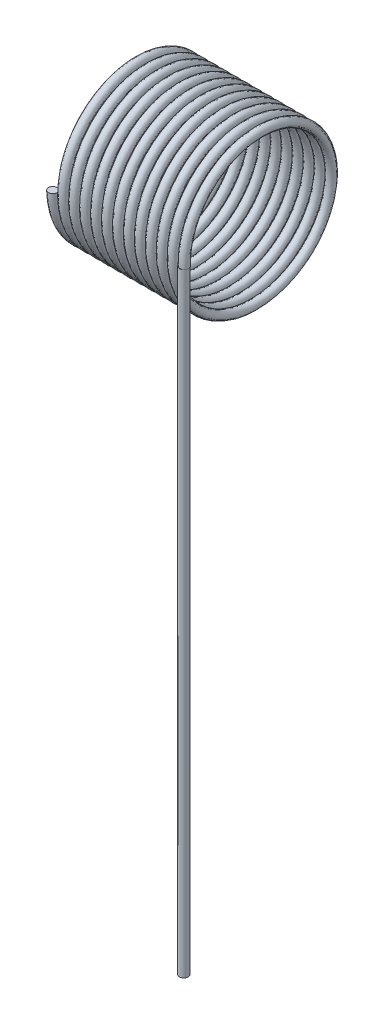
ISO-10303-21;
HEADER;
FILE_DESCRIPTION(('STEP AP214'),'2;1');
FILE_NAME('part.step','',(''),(''),'','','');
FILE_SCHEMA(('AUTOMOTIVE_DESIGN { 1 0 10303 214 1 1 1 1 }'));
ENDSEC;
DATA;
#1=APPLICATION_CONTEXT('core data for automotive mechanical design processes');
#2=APPLICATION_PROTOCOL_DEFINITION('international standard','automotive_design',2000,#1);
#3=PRODUCT_CONTEXT('',#1,'mechanical');
#4=PRODUCT('Part','Part','',(#3));
#5=PRODUCT_RELATED_PRODUCT_CATEGORY('part','',(#4));
#6=PRODUCT_DEFINITION_FORMATION('','',#4);
#7=PRODUCT_DEFINITION_CONTEXT('part definition',#1,'design');
#8=PRODUCT_DEFINITION('design','',#6,#7);
#9=PRODUCT_DEFINITION_SHAPE('','',#8);
#10=(LENGTH_UNIT() NAMED_UNIT(*) SI_UNIT(.MILLI.,.METRE.));
#11=(NAMED_UNIT(*) PLANE_ANGLE_UNIT() SI_UNIT($,.RADIAN.));
#12=(NAMED_UNIT(*) SI_UNIT($,.STERADIAN.) SOLID_ANGLE_UNIT());
#13=UNCERTAINTY_MEASURE_WITH_UNIT(LENGTH_MEASURE(1.E-05),#10,'distance_accuracy_value','');
#14=(GEOMETRIC_REPRESENTATION_CONTEXT(3) GLOBAL_UNCERTAINTY_ASSIGNED_CONTEXT((#13)) GLOBAL_UNIT_ASSIGNED_CONTEXT((#10,
#11,#12)) REPRESENTATION_CONTEXT('',''));
#15=CARTESIAN_POINT('',(0.,0.,0.));
#16=DIRECTION('',(0.,0.,1.));
#17=DIRECTION('',(1.,0.,0.));
#18=AXIS2_PLACEMENT_3D('',#15,#16,#17);
#19=CARTESIAN_POINT('',(80.103090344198,-199.000000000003,17.390186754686));
#20=DIRECTION('',(0.,1.,1.6759110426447E-13));
#21=DIRECTION('',(0.,-1.6759110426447E-13,1.));
#22=AXIS2_PLACEMENT_3D('',#19,#20,#21);
#23=PLANE('',#22);
#24=CARTESIAN_POINT('',(80.0775878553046,-199.000000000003,17.4531506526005));
#25=DIRECTION('',(0.,-1.,-1.6759110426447E-13));
#26=DIRECTION('',(0.,1.6759110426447E-13,-1.));
#27=AXIS2_PLACEMENT_3D('',#24,#25,#26);
#28=CIRCLE('',#27,1.00288229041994);
#29=CARTESIAN_POINT('',(79.179464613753,-199.000000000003,17.0068911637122));
#30=VERTEX_POINT('',#29);
#31=CARTESIAN_POINT('',(81.0331157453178,-199.000000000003,17.7576819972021));
#32=VERTEX_POINT('',#31);
#33=EDGE_CURVE('E394',#30,#32,#28,.T.);
#34=ORIENTED_EDGE('',*,*,#33,.F.);
#35=CARTESIAN_POINT('',(80.103090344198,-199.000000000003,17.390186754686));
#36=DIRECTION('',(0.,1.,1.6759110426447E-13));
#37=DIRECTION('',(0.,-1.6759110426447E-13,1.));
#38=AXIS2_PLACEMENT_3D('',#35,#36,#37);
#39=CIRCLE('',#38,0.999999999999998);
#40=EDGE_CURVE('E374',#32,#30,#39,.T.);
#41=ORIENTED_EDGE('',*,*,#40,.F.);
#42=EDGE_LOOP('',(#34,#41));
#43=FACE_BOUND('',#42,.T.);
#44=ADVANCED_FACE('F364',(#43),#23,.F.);
#45=CARTESIAN_POINT('',(50.103090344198,-199.,17.390186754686));
#46=DIRECTION('',(0.,1.,0.));
#47=DIRECTION('',(0.,0.,1.));
#48=AXIS2_PLACEMENT_3D('',#45,#46,#47);
#49=PLANE('',#48);
#50=CARTESIAN_POINT('',(50.103090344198,-199.,17.390186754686));
#51=DIRECTION('',(0.,1.,0.));
#52=DIRECTION('',(0.,0.,1.));
#53=AXIS2_PLACEMENT_3D('',#50,#51,#52);
#54=CIRCLE('',#53,0.999999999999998);
#55=CARTESIAN_POINT('',(50.103090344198,-199.,18.390186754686));
#56=VERTEX_POINT('',#55);
#57=EDGE_CURVE('E386',#56,#56,#54,.T.);
#58=ORIENTED_EDGE('',*,*,#57,.T.);
#59=EDGE_LOOP('',(#58));
#60=FACE_BOUND('',#59,.T.);
#61=ADVANCED_FACE('F414',(#60),#49,.T.);
#62=CARTESIAN_POINT('',(50.103090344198,-199.,18.390186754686));
#63=CARTESIAN_POINT('',(50.3114236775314,-209.617579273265,18.3901867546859));
#64=CARTESIAN_POINT('',(50.5197570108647,-214.926368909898,9.19509337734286));
#65=CARTESIAN_POINT('',(50.728090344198,-220.235158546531,-1.94587214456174E-13));
#66=CARTESIAN_POINT('',(50.9364236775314,-214.926368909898,-9.19509337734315));
#67=CARTESIAN_POINT('',(51.1447570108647,-209.617579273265,-18.3901867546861));
#68=CARTESIAN_POINT('',(51.353090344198,-199.,-18.390186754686));
#69=CARTESIAN_POINT('',(51.5614236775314,-188.382420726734,-18.3901867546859));
#70=CARTESIAN_POINT('',(51.7697570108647,-183.073631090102,-9.19509337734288));
#71=CARTESIAN_POINT('',(51.978090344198,-177.764841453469,1.8480420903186E-13));
#72=CARTESIAN_POINT('',(52.1864236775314,-183.073631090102,9.19509337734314));
#73=CARTESIAN_POINT('',(52.3947570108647,-188.382420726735,18.3901867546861));
#74=CARTESIAN_POINT('',(52.603090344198,-199.,18.390186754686));
#75=CARTESIAN_POINT('',(52.8114236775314,-209.617579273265,18.3901867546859));
#76=CARTESIAN_POINT('',(53.0197570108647,-214.926368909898,9.19509337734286));
#77=CARTESIAN_POINT('',(53.228090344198,-220.235158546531,-1.94587214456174E-13));
#78=CARTESIAN_POINT('',(53.4364236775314,-214.926368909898,-9.19509337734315));
#79=CARTESIAN_POINT('',(53.6447570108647,-209.617579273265,-18.3901867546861));
#80=CARTESIAN_POINT('',(53.853090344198,-199.,-18.390186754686));
#81=CARTESIAN_POINT('',(54.0614236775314,-188.382420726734,-18.3901867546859));
#82=CARTESIAN_POINT('',(54.2697570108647,-183.073631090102,-9.19509337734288));
#83=CARTESIAN_POINT('',(54.478090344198,-177.764841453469,1.8480420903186E-13));
#84=CARTESIAN_POINT('',(54.6864236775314,-183.073631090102,9.19509337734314));
#85=CARTESIAN_POINT('',(54.8947570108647,-188.382420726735,18.3901867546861));
#86=CARTESIAN_POINT('',(55.103090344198,-199.,18.390186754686));
#87=CARTESIAN_POINT('',(55.3114236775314,-209.617579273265,18.3901867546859));
#88=CARTESIAN_POINT('',(55.5197570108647,-214.926368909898,9.19509337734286));
#89=CARTESIAN_POINT('',(55.728090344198,-220.235158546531,-1.94587214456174E-13));
#90=CARTESIAN_POINT('',(55.9364236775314,-214.926368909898,-9.19509337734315));
#91=CARTESIAN_POINT('',(56.1447570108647,-209.617579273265,-18.3901867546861));
#92=CARTESIAN_POINT('',(56.353090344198,-199.,-18.390186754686));
#93=CARTESIAN_POINT('',(56.5614236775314,-188.382420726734,-18.3901867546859));
#94=CARTESIAN_POINT('',(56.7697570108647,-183.073631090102,-9.19509337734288));
#95=CARTESIAN_POINT('',(56.978090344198,-177.764841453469,1.8480420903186E-13));
#96=CARTESIAN_POINT('',(57.1864236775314,-183.073631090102,9.19509337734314));
#97=CARTESIAN_POINT('',(57.3947570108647,-188.382420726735,18.3901867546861));
#98=CARTESIAN_POINT('',(57.603090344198,-199.,18.390186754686));
#99=CARTESIAN_POINT('',(57.8114236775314,-209.617579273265,18.3901867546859));
#100=CARTESIAN_POINT('',(58.0197570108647,-214.926368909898,9.19509337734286));
#101=CARTESIAN_POINT('',(58.228090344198,-220.235158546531,-1.94587214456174E-13));
#102=CARTESIAN_POINT('',(58.4364236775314,-214.926368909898,-9.19509337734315));
#103=CARTESIAN_POINT('',(58.6447570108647,-209.617579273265,-18.3901867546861));
#104=CARTESIAN_POINT('',(58.853090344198,-199.,-18.390186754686));
#105=CARTESIAN_POINT('',(59.0614236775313,-188.382420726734,-18.3901867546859));
#106=CARTESIAN_POINT('',(59.2697570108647,-183.073631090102,-9.19509337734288));
#107=CARTESIAN_POINT('',(59.478090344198,-177.764841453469,1.8480420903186E-13));
#108=CARTESIAN_POINT('',(59.6864236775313,-183.073631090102,9.19509337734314));
#109=CARTESIAN_POINT('',(59.8947570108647,-188.382420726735,18.3901867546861));
#110=CARTESIAN_POINT('',(60.103090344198,-199.,18.390186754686));
#111=CARTESIAN_POINT('',(60.3114236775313,-209.617579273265,18.3901867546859));
#112=CARTESIAN_POINT('',(60.5197570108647,-214.926368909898,9.19509337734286));
#113=CARTESIAN_POINT('',(60.728090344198,-220.235158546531,-1.94587214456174E-13));
#114=CARTESIAN_POINT('',(60.9364236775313,-214.926368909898,-9.19509337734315));
#115=CARTESIAN_POINT('',(61.1447570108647,-209.617579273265,-18.3901867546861));
#116=CARTESIAN_POINT('',(61.353090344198,-199.,-18.390186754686));
#117=CARTESIAN_POINT('',(61.5614236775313,-188.382420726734,-18.3901867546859));
#118=CARTESIAN_POINT('',(61.7697570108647,-183.073631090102,-9.19509337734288));
#119=CARTESIAN_POINT('',(61.978090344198,-177.764841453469,1.8480420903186E-13));
#120=CARTESIAN_POINT('',(62.1864236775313,-183.073631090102,9.19509337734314));
#121=CARTESIAN_POINT('',(62.3947570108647,-188.382420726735,18.3901867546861));
#122=CARTESIAN_POINT('',(62.603090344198,-199.,18.390186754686));
#123=CARTESIAN_POINT('',(62.8114236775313,-209.617579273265,18.3901867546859));
#124=CARTESIAN_POINT('',(63.0197570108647,-214.926368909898,9.19509337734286));
#125=CARTESIAN_POINT('',(63.228090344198,-220.235158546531,-1.94587214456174E-13));
#126=CARTESIAN_POINT('',(63.4364236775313,-214.926368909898,-9.19509337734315));
#127=CARTESIAN_POINT('',(63.6447570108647,-209.617579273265,-18.3901867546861));
#128=CARTESIAN_POINT('',(63.853090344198,-199.,-18.390186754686));
#129=CARTESIAN_POINT('',(64.0614236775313,-188.382420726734,-18.3901867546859));
#130=CARTESIAN_POINT('',(64.2697570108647,-183.073631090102,-9.19509337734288));
#131=CARTESIAN_POINT('',(64.478090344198,-177.764841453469,1.8480420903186E-13));
#132=CARTESIAN_POINT('',(64.6864236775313,-183.073631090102,9.19509337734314));
#133=CARTESIAN_POINT('',(64.8947570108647,-188.382420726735,18.3901867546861));
#134=CARTESIAN_POINT('',(65.103090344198,-199.,18.390186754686));
#135=CARTESIAN_POINT('',(65.3114236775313,-209.617579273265,18.3901867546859));
#136=CARTESIAN_POINT('',(65.5197570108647,-214.926368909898,9.19509337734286));
#137=CARTESIAN_POINT('',(65.728090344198,-220.235158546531,-1.94587214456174E-13));
#138=CARTESIAN_POINT('',(65.9364236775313,-214.926368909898,-9.19509337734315));
#139=CARTESIAN_POINT('',(66.1447570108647,-209.617579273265,-18.3901867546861));
#140=CARTESIAN_POINT('',(66.353090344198,-199.,-18.390186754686));
#141=CARTESIAN_POINT('',(66.5614236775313,-188.382420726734,-18.3901867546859));
#142=CARTESIAN_POINT('',(66.7697570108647,-183.073631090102,-9.19509337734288));
#143=CARTESIAN_POINT('',(66.978090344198,-177.764841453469,1.8480420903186E-13));
#144=CARTESIAN_POINT('',(67.1864236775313,-183.073631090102,9.19509337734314));
#145=CARTESIAN_POINT('',(67.3947570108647,-188.382420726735,18.3901867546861));
#146=CARTESIAN_POINT('',(67.603090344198,-199.,18.390186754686));
#147=CARTESIAN_POINT('',(67.8114236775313,-209.617579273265,18.3901867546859));
#148=CARTESIAN_POINT('',(68.0197570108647,-214.926368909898,9.19509337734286));
#149=CARTESIAN_POINT('',(68.228090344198,-220.235158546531,-1.94587214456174E-13));
#150=CARTESIAN_POINT('',(68.4364236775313,-214.926368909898,-9.19509337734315));
#151=CARTESIAN_POINT('',(68.6447570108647,-209.617579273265,-18.3901867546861));
#152=CARTESIAN_POINT('',(68.853090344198,-199.,-18.390186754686));
#153=CARTESIAN_POINT('',(69.0614236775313,-188.382420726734,-18.3901867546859));
#154=CARTESIAN_POINT('',(69.2697570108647,-183.073631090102,-9.19509337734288));
#155=CARTESIAN_POINT('',(69.478090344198,-177.764841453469,1.8480420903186E-13));
#156=CARTESIAN_POINT('',(69.6864236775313,-183.073631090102,9.19509337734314));
#157=CARTESIAN_POINT('',(69.8947570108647,-188.382420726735,18.3901867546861));
#158=CARTESIAN_POINT('',(70.103090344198,-199.,18.390186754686));
#159=CARTESIAN_POINT('',(70.3114236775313,-209.617579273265,18.3901867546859));
#160=CARTESIAN_POINT('',(70.5197570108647,-214.926368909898,9.19509337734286));
#161=CARTESIAN_POINT('',(70.728090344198,-220.235158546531,-1.94587214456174E-13));
#162=CARTESIAN_POINT('',(70.9364236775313,-214.926368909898,-9.19509337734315));
#163=CARTESIAN_POINT('',(71.1447570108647,-209.617579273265,-18.3901867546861));
#164=CARTESIAN_POINT('',(71.353090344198,-199.,-18.390186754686));
#165=CARTESIAN_POINT('',(71.5614236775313,-188.382420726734,-18.3901867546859));
#166=CARTESIAN_POINT('',(71.7697570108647,-183.073631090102,-9.19509337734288));
#167=CARTESIAN_POINT('',(71.978090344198,-177.764841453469,1.8480420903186E-13));
#168=CARTESIAN_POINT('',(72.1864236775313,-183.073631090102,9.19509337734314));
#169=CARTESIAN_POINT('',(72.3947570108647,-188.382420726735,18.3901867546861));
#170=CARTESIAN_POINT('',(72.603090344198,-199.,18.390186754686));
#171=CARTESIAN_POINT('',(72.8114236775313,-209.617579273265,18.3901867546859));
#172=CARTESIAN_POINT('',(73.0197570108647,-214.926368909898,9.19509337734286));
#173=CARTESIAN_POINT('',(73.228090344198,-220.235158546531,-1.94587214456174E-13));
#174=CARTESIAN_POINT('',(73.4364236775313,-214.926368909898,-9.19509337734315));
#175=CARTESIAN_POINT('',(73.6447570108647,-209.617579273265,-18.3901867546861));
#176=CARTESIAN_POINT('',(73.853090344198,-199.,-18.390186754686));
#177=CARTESIAN_POINT('',(74.0614236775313,-188.382420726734,-18.3901867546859));
#178=CARTESIAN_POINT('',(74.2697570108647,-183.073631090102,-9.19509337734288));
#179=CARTESIAN_POINT('',(74.478090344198,-177.764841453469,1.8480420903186E-13));
#180=CARTESIAN_POINT('',(74.6864236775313,-183.073631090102,9.19509337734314));
#181=CARTESIAN_POINT('',(74.8947570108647,-188.382420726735,18.3901867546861));
#182=CARTESIAN_POINT('',(75.103090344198,-199.,18.390186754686));
#183=CARTESIAN_POINT('',(75.3114236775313,-209.617579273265,18.3901867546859));
#184=CARTESIAN_POINT('',(75.5197570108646,-214.926368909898,9.19509337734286));
#185=CARTESIAN_POINT('',(75.728090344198,-220.235158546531,-1.94587214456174E-13));
#186=CARTESIAN_POINT('',(75.9364236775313,-214.926368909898,-9.19509337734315));
#187=CARTESIAN_POINT('',(76.1447570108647,-209.617579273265,-18.3901867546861));
#188=CARTESIAN_POINT('',(76.353090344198,-199.,-18.390186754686));
#189=CARTESIAN_POINT('',(76.5614236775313,-188.382420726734,-18.3901867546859));
#190=CARTESIAN_POINT('',(76.7697570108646,-183.073631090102,-9.19509337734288));
#191=CARTESIAN_POINT('',(76.978090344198,-177.764841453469,1.8480420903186E-13));
#192=CARTESIAN_POINT('',(77.1864236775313,-183.073631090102,9.19509337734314));
#193=CARTESIAN_POINT('',(77.3947570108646,-188.382420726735,18.3901867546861));
#194=CARTESIAN_POINT('',(77.603090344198,-199.,18.390186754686));
#195=CARTESIAN_POINT('',(77.8114236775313,-209.617579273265,18.3901867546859));
#196=CARTESIAN_POINT('',(78.0197570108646,-214.926368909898,9.19509337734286));
#197=CARTESIAN_POINT('',(78.228090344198,-220.235158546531,-1.94587214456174E-13));
#198=CARTESIAN_POINT('',(78.4364236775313,-214.926368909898,-9.19509337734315));
#199=CARTESIAN_POINT('',(78.6447570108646,-209.617579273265,-18.3901867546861));
#200=CARTESIAN_POINT('',(78.853090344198,-199.,-18.390186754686));
#201=CARTESIAN_POINT('',(79.0614236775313,-188.382420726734,-18.3901867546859));
#202=CARTESIAN_POINT('',(79.2697570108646,-183.073631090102,-9.19509337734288));
#203=CARTESIAN_POINT('',(79.478090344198,-177.764841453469,1.8480420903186E-13));
#204=CARTESIAN_POINT('',(79.6864236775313,-183.073631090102,9.19509337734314));
#205=CARTESIAN_POINT('',(79.8947570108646,-188.382420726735,18.3901867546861));
#206=CARTESIAN_POINT('',(80.103090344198,-199.,18.390186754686));
#207=CARTESIAN_POINT('',(80.3114236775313,-209.617579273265,18.3901867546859));
#208=CARTESIAN_POINT('',(80.5197570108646,-214.926368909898,9.19509337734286));
#209=CARTESIAN_POINT('',(80.728090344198,-220.235158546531,-1.94587214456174E-13));
#210=CARTESIAN_POINT('',(80.9364236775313,-214.926368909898,-9.19509337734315));
#211=CARTESIAN_POINT('',(81.1447570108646,-209.617579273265,-18.3901867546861));
#212=CARTESIAN_POINT('',(81.353090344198,-199.,-18.390186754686));
#213=CARTESIAN_POINT('',(81.5614236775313,-188.382420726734,-18.3901867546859));
#214=CARTESIAN_POINT('',(81.7697570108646,-183.073631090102,-9.19509337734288));
#215=CARTESIAN_POINT('',(81.978090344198,-177.764841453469,1.8480420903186E-13));
#216=CARTESIAN_POINT('',(82.1864236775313,-183.073631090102,9.19509337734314));
#217=CARTESIAN_POINT('',(82.3947570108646,-188.382420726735,18.3901867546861));
#218=CARTESIAN_POINT('',(82.603090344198,-199.,18.390186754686));
#219=CARTESIAN_POINT('',(52.103090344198,-199.,18.390186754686));
#220=CARTESIAN_POINT('',(52.3114236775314,-209.617579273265,18.3901867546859));
#221=CARTESIAN_POINT('',(52.5197570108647,-214.926368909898,9.19509337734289));
#222=CARTESIAN_POINT('',(52.728090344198,-220.235158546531,-1.62537836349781E-13));
#223=CARTESIAN_POINT('',(52.9364236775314,-214.926368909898,-9.19509337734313));
#224=CARTESIAN_POINT('',(53.1447570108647,-209.617579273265,-18.3901867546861));
#225=CARTESIAN_POINT('',(53.353090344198,-199.,-18.390186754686));
#226=CARTESIAN_POINT('',(53.5614236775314,-188.382420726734,-18.3901867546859));
#227=CARTESIAN_POINT('',(53.7697570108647,-183.073631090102,-9.1950933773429));
#228=CARTESIAN_POINT('',(53.978090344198,-177.764841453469,1.52754830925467E-13));
#229=CARTESIAN_POINT('',(54.1864236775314,-183.073631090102,9.19509337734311));
#230=CARTESIAN_POINT('',(54.3947570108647,-188.382420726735,18.3901867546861));
#231=CARTESIAN_POINT('',(54.603090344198,-199.,18.390186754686));
#232=CARTESIAN_POINT('',(54.8114236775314,-209.617579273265,18.3901867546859));
#233=CARTESIAN_POINT('',(55.0197570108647,-214.926368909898,9.19509337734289));
#234=CARTESIAN_POINT('',(55.228090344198,-220.235158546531,-1.62537836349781E-13));
#235=CARTESIAN_POINT('',(55.4364236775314,-214.926368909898,-9.19509337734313));
#236=CARTESIAN_POINT('',(55.6447570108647,-209.617579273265,-18.3901867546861));
#237=CARTESIAN_POINT('',(55.853090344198,-199.,-18.390186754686));
#238=CARTESIAN_POINT('',(56.0614236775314,-188.382420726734,-18.3901867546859));
#239=CARTESIAN_POINT('',(56.2697570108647,-183.073631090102,-9.1950933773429));
#240=CARTESIAN_POINT('',(56.478090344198,-177.764841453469,1.52754830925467E-13));
#241=CARTESIAN_POINT('',(56.6864236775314,-183.073631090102,9.19509337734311));
#242=CARTESIAN_POINT('',(56.8947570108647,-188.382420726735,18.3901867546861));
#243=CARTESIAN_POINT('',(57.103090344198,-199.,18.390186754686));
#244=CARTESIAN_POINT('',(57.3114236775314,-209.617579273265,18.3901867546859));
#245=CARTESIAN_POINT('',(57.5197570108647,-214.926368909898,9.19509337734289));
#246=CARTESIAN_POINT('',(57.728090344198,-220.235158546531,-1.62537836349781E-13));
#247=CARTESIAN_POINT('',(57.9364236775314,-214.926368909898,-9.19509337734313));
#248=CARTESIAN_POINT('',(58.1447570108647,-209.617579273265,-18.3901867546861));
#249=CARTESIAN_POINT('',(58.353090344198,-199.,-18.390186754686));
#250=CARTESIAN_POINT('',(58.5614236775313,-188.382420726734,-18.3901867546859));
#251=CARTESIAN_POINT('',(58.7697570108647,-183.073631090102,-9.1950933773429));
#252=CARTESIAN_POINT('',(58.978090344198,-177.764841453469,1.52754830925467E-13));
#253=CARTESIAN_POINT('',(59.1864236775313,-183.073631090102,9.19509337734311));
#254=CARTESIAN_POINT('',(59.3947570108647,-188.382420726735,18.3901867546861));
#255=CARTESIAN_POINT('',(59.603090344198,-199.,18.390186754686));
#256=CARTESIAN_POINT('',(59.8114236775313,-209.617579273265,18.3901867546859));
#257=CARTESIAN_POINT('',(60.0197570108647,-214.926368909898,9.19509337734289));
#258=CARTESIAN_POINT('',(60.228090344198,-220.235158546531,-1.62537836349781E-13));
#259=CARTESIAN_POINT('',(60.4364236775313,-214.926368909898,-9.19509337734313));
#260=CARTESIAN_POINT('',(60.6447570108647,-209.617579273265,-18.3901867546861));
#261=CARTESIAN_POINT('',(60.853090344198,-199.,-18.390186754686));
#262=CARTESIAN_POINT('',(61.0614236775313,-188.382420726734,-18.3901867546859));
#263=CARTESIAN_POINT('',(61.2697570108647,-183.073631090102,-9.1950933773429));
#264=CARTESIAN_POINT('',(61.478090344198,-177.764841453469,1.52754830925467E-13));
#265=CARTESIAN_POINT('',(61.6864236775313,-183.073631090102,9.19509337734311));
#266=CARTESIAN_POINT('',(61.8947570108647,-188.382420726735,18.3901867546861));
#267=CARTESIAN_POINT('',(62.103090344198,-199.,18.390186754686));
#268=CARTESIAN_POINT('',(62.3114236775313,-209.617579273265,18.3901867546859));
#269=CARTESIAN_POINT('',(62.5197570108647,-214.926368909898,9.19509337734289));
#270=CARTESIAN_POINT('',(62.728090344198,-220.235158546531,-1.62537836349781E-13));
#271=CARTESIAN_POINT('',(62.9364236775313,-214.926368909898,-9.19509337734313));
#272=CARTESIAN_POINT('',(63.1447570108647,-209.617579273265,-18.3901867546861));
#273=CARTESIAN_POINT('',(63.353090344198,-199.,-18.390186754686));
#274=CARTESIAN_POINT('',(63.5614236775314,-188.382420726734,-18.3901867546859));
#275=CARTESIAN_POINT('',(63.7697570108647,-183.073631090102,-9.1950933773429));
#276=CARTESIAN_POINT('',(63.978090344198,-177.764841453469,1.52754830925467E-13));
#277=CARTESIAN_POINT('',(64.1864236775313,-183.073631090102,9.19509337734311));
#278=CARTESIAN_POINT('',(64.3947570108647,-188.382420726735,18.3901867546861));
#279=CARTESIAN_POINT('',(64.603090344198,-199.,18.390186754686));
#280=CARTESIAN_POINT('',(64.8114236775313,-209.617579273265,18.3901867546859));
#281=CARTESIAN_POINT('',(65.0197570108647,-214.926368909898,9.19509337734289));
#282=CARTESIAN_POINT('',(65.228090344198,-220.235158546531,-1.62537836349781E-13));
#283=CARTESIAN_POINT('',(65.4364236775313,-214.926368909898,-9.19509337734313));
#284=CARTESIAN_POINT('',(65.6447570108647,-209.617579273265,-18.3901867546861));
#285=CARTESIAN_POINT('',(65.853090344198,-199.,-18.390186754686));
#286=CARTESIAN_POINT('',(66.0614236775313,-188.382420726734,-18.3901867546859));
#287=CARTESIAN_POINT('',(66.2697570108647,-183.073631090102,-9.1950933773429));
#288=CARTESIAN_POINT('',(66.478090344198,-177.764841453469,1.52754830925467E-13));
#289=CARTESIAN_POINT('',(66.6864236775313,-183.073631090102,9.19509337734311));
#290=CARTESIAN_POINT('',(66.8947570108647,-188.382420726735,18.3901867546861));
#291=CARTESIAN_POINT('',(67.103090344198,-199.,18.390186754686));
#292=CARTESIAN_POINT('',(67.3114236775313,-209.617579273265,18.3901867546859));
#293=CARTESIAN_POINT('',(67.5197570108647,-214.926368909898,9.19509337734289));
#294=CARTESIAN_POINT('',(67.728090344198,-220.235158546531,-1.62537836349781E-13));
#295=CARTESIAN_POINT('',(67.9364236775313,-214.926368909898,-9.19509337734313));
#296=CARTESIAN_POINT('',(68.1447570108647,-209.617579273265,-18.3901867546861));
#297=CARTESIAN_POINT('',(68.353090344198,-199.,-18.390186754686));
#298=CARTESIAN_POINT('',(68.5614236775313,-188.382420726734,-18.3901867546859));
#299=CARTESIAN_POINT('',(68.7697570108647,-183.073631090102,-9.1950933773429));
#300=CARTESIAN_POINT('',(68.978090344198,-177.764841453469,1.52754830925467E-13));
#301=CARTESIAN_POINT('',(69.1864236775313,-183.073631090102,9.19509337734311));
#302=CARTESIAN_POINT('',(69.3947570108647,-188.382420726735,18.3901867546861));
#303=CARTESIAN_POINT('',(69.603090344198,-199.,18.390186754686));
#304=CARTESIAN_POINT('',(69.8114236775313,-209.617579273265,18.3901867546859));
#305=CARTESIAN_POINT('',(70.0197570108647,-214.926368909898,9.19509337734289));
#306=CARTESIAN_POINT('',(70.228090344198,-220.235158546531,-1.62537836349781E-13));
#307=CARTESIAN_POINT('',(70.4364236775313,-214.926368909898,-9.19509337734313));
#308=CARTESIAN_POINT('',(70.6447570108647,-209.617579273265,-18.3901867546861));
#309=CARTESIAN_POINT('',(70.853090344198,-199.,-18.390186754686));
#310=CARTESIAN_POINT('',(71.0614236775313,-188.382420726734,-18.3901867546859));
#311=CARTESIAN_POINT('',(71.2697570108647,-183.073631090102,-9.1950933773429));
#312=CARTESIAN_POINT('',(71.478090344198,-177.764841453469,1.52754830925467E-13));
#313=CARTESIAN_POINT('',(71.6864236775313,-183.073631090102,9.19509337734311));
#314=CARTESIAN_POINT('',(71.8947570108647,-188.382420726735,18.3901867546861));
#315=CARTESIAN_POINT('',(72.103090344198,-199.,18.390186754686));
#316=CARTESIAN_POINT('',(72.3114236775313,-209.617579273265,18.3901867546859));
#317=CARTESIAN_POINT('',(72.5197570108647,-214.926368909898,9.19509337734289));
#318=CARTESIAN_POINT('',(72.728090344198,-220.235158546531,-1.62537836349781E-13));
#319=CARTESIAN_POINT('',(72.9364236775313,-214.926368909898,-9.19509337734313));
#320=CARTESIAN_POINT('',(73.1447570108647,-209.617579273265,-18.3901867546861));
#321=CARTESIAN_POINT('',(73.353090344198,-199.,-18.390186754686));
#322=CARTESIAN_POINT('',(73.5614236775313,-188.382420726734,-18.3901867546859));
#323=CARTESIAN_POINT('',(73.7697570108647,-183.073631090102,-9.1950933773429));
#324=CARTESIAN_POINT('',(73.978090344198,-177.764841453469,1.52754830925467E-13));
#325=CARTESIAN_POINT('',(74.1864236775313,-183.073631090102,9.19509337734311));
#326=CARTESIAN_POINT('',(74.3947570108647,-188.382420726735,18.3901867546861));
#327=CARTESIAN_POINT('',(74.603090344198,-199.,18.390186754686));
#328=CARTESIAN_POINT('',(74.8114236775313,-209.617579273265,18.3901867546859));
#329=CARTESIAN_POINT('',(75.0197570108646,-214.926368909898,9.19509337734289));
#330=CARTESIAN_POINT('',(75.228090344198,-220.235158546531,-1.62537836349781E-13));
#331=CARTESIAN_POINT('',(75.4364236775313,-214.926368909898,-9.19509337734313));
#332=CARTESIAN_POINT('',(75.6447570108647,-209.617579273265,-18.3901867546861));
#333=CARTESIAN_POINT('',(75.853090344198,-199.,-18.390186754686));
#334=CARTESIAN_POINT('',(76.0614236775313,-188.382420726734,-18.3901867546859));
#335=CARTESIAN_POINT('',(76.2697570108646,-183.073631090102,-9.1950933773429));
#336=CARTESIAN_POINT('',(76.478090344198,-177.764841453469,1.52754830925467E-13));
#337=CARTESIAN_POINT('',(76.6864236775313,-183.073631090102,9.19509337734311));
#338=CARTESIAN_POINT('',(76.8947570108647,-188.382420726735,18.3901867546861));
#339=CARTESIAN_POINT('',(77.103090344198,-199.,18.390186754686));
#340=CARTESIAN_POINT('',(77.3114236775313,-209.617579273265,18.3901867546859));
#341=CARTESIAN_POINT('',(77.5197570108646,-214.926368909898,9.19509337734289));
#342=CARTESIAN_POINT('',(77.728090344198,-220.235158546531,-1.62537836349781E-13));
#343=CARTESIAN_POINT('',(77.9364236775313,-214.926368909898,-9.19509337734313));
#344=CARTESIAN_POINT('',(78.1447570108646,-209.617579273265,-18.3901867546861));
#345=CARTESIAN_POINT('',(78.353090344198,-199.,-18.390186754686));
#346=CARTESIAN_POINT('',(78.5614236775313,-188.382420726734,-18.3901867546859));
#347=CARTESIAN_POINT('',(78.7697570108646,-183.073631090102,-9.1950933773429));
#348=CARTESIAN_POINT('',(78.978090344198,-177.764841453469,1.52754830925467E-13));
#349=CARTESIAN_POINT('',(79.1864236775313,-183.073631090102,9.19509337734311));
#350=CARTESIAN_POINT('',(79.3947570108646,-188.382420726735,18.3901867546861));
#351=CARTESIAN_POINT('',(79.603090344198,-199.,18.390186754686));
#352=CARTESIAN_POINT('',(79.8114236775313,-209.617579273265,18.3901867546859));
#353=CARTESIAN_POINT('',(80.0197570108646,-214.926368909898,9.19509337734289));
#354=CARTESIAN_POINT('',(80.228090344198,-220.235158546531,-1.62537836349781E-13));
#355=CARTESIAN_POINT('',(80.4364236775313,-214.926368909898,-9.19509337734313));
#356=CARTESIAN_POINT('',(80.6447570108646,-209.617579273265,-18.3901867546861));
#357=CARTESIAN_POINT('',(80.853090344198,-199.,-18.390186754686));
#358=CARTESIAN_POINT('',(81.0614236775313,-188.382420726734,-18.3901867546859));
#359=CARTESIAN_POINT('',(81.2697570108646,-183.073631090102,-9.1950933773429));
#360=CARTESIAN_POINT('',(81.478090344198,-177.764841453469,1.52754830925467E-13));
#361=CARTESIAN_POINT('',(81.6864236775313,-183.073631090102,9.19509337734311));
#362=CARTESIAN_POINT('',(81.8947570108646,-188.382420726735,18.3901867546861));
#363=CARTESIAN_POINT('',(82.103090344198,-199.,18.390186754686));
#364=CARTESIAN_POINT('',(82.3114236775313,-209.617579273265,18.3901867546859));
#365=CARTESIAN_POINT('',(82.5197570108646,-214.926368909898,9.19509337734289));
#366=CARTESIAN_POINT('',(82.728090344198,-220.235158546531,-1.62537836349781E-13));
#367=CARTESIAN_POINT('',(82.9364236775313,-214.926368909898,-9.19509337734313));
#368=CARTESIAN_POINT('',(83.1447570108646,-209.617579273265,-18.3901867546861));
#369=CARTESIAN_POINT('',(83.353090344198,-199.,-18.390186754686));
#370=CARTESIAN_POINT('',(83.5614236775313,-188.382420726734,-18.3901867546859));
#371=CARTESIAN_POINT('',(83.7697570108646,-183.073631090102,-9.1950933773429));
#372=CARTESIAN_POINT('',(83.978090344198,-177.764841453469,1.52754830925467E-13));
#373=CARTESIAN_POINT('',(84.1864236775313,-183.073631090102,9.19509337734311));
#374=CARTESIAN_POINT('',(84.3947570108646,-188.382420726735,18.3901867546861));
#375=CARTESIAN_POINT('',(84.603090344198,-199.,18.390186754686));
#376=CARTESIAN_POINT('',(52.103090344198,-199.,16.390186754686));
#377=CARTESIAN_POINT('',(52.3114236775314,-208.462878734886,16.3901867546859));
#378=CARTESIAN_POINT('',(52.5197570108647,-213.194318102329,8.19509337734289));
#379=CARTESIAN_POINT('',(52.728090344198,-217.925757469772,-1.62679246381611E-13));
#380=CARTESIAN_POINT('',(52.9364236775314,-213.194318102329,-8.19509337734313));
#381=CARTESIAN_POINT('',(53.1447570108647,-208.462878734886,-16.3901867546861));
#382=CARTESIAN_POINT('',(53.353090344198,-199.,-16.390186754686));
#383=CARTESIAN_POINT('',(53.5614236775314,-189.537121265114,-16.3901867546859));
#384=CARTESIAN_POINT('',(53.7697570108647,-184.80568189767,-8.1950933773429));
#385=CARTESIAN_POINT('',(53.978090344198,-180.074242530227,1.53179061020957E-13));
#386=CARTESIAN_POINT('',(54.1864236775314,-184.805681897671,8.19509337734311));
#387=CARTESIAN_POINT('',(54.3947570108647,-189.537121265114,16.3901867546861));
#388=CARTESIAN_POINT('',(54.603090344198,-199.,16.390186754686));
#389=CARTESIAN_POINT('',(54.8114236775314,-208.462878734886,16.3901867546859));
#390=CARTESIAN_POINT('',(55.0197570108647,-213.194318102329,8.19509337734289));
#391=CARTESIAN_POINT('',(55.228090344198,-217.925757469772,-1.62679246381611E-13));
#392=CARTESIAN_POINT('',(55.4364236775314,-213.194318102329,-8.19509337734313));
#393=CARTESIAN_POINT('',(55.6447570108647,-208.462878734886,-16.3901867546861));
#394=CARTESIAN_POINT('',(55.853090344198,-199.,-16.390186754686));
#395=CARTESIAN_POINT('',(56.0614236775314,-189.537121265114,-16.3901867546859));
#396=CARTESIAN_POINT('',(56.2697570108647,-184.80568189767,-8.1950933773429));
#397=CARTESIAN_POINT('',(56.478090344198,-180.074242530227,1.53179061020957E-13));
#398=CARTESIAN_POINT('',(56.6864236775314,-184.805681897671,8.19509337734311));
#399=CARTESIAN_POINT('',(56.8947570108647,-189.537121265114,16.3901867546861));
#400=CARTESIAN_POINT('',(57.103090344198,-199.,16.390186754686));
#401=CARTESIAN_POINT('',(57.3114236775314,-208.462878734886,16.3901867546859));
#402=CARTESIAN_POINT('',(57.5197570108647,-213.194318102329,8.19509337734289));
#403=CARTESIAN_POINT('',(57.728090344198,-217.925757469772,-1.62679246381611E-13));
#404=CARTESIAN_POINT('',(57.9364236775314,-213.194318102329,-8.19509337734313));
#405=CARTESIAN_POINT('',(58.1447570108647,-208.462878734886,-16.3901867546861));
#406=CARTESIAN_POINT('',(58.353090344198,-199.,-16.390186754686));
#407=CARTESIAN_POINT('',(58.5614236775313,-189.537121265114,-16.3901867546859));
#408=CARTESIAN_POINT('',(58.7697570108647,-184.80568189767,-8.1950933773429));
#409=CARTESIAN_POINT('',(58.978090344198,-180.074242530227,1.53179061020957E-13));
#410=CARTESIAN_POINT('',(59.1864236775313,-184.805681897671,8.19509337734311));
#411=CARTESIAN_POINT('',(59.3947570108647,-189.537121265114,16.3901867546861));
#412=CARTESIAN_POINT('',(59.603090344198,-199.,16.390186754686));
#413=CARTESIAN_POINT('',(59.8114236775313,-208.462878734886,16.3901867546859));
#414=CARTESIAN_POINT('',(60.0197570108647,-213.194318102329,8.19509337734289));
#415=CARTESIAN_POINT('',(60.228090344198,-217.925757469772,-1.62679246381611E-13));
#416=CARTESIAN_POINT('',(60.4364236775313,-213.194318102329,-8.19509337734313));
#417=CARTESIAN_POINT('',(60.6447570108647,-208.462878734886,-16.3901867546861));
#418=CARTESIAN_POINT('',(60.853090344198,-199.,-16.390186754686));
#419=CARTESIAN_POINT('',(61.0614236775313,-189.537121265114,-16.3901867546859));
#420=CARTESIAN_POINT('',(61.2697570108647,-184.80568189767,-8.1950933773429));
#421=CARTESIAN_POINT('',(61.478090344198,-180.074242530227,1.53179061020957E-13));
#422=CARTESIAN_POINT('',(61.6864236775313,-184.805681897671,8.19509337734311));
#423=CARTESIAN_POINT('',(61.8947570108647,-189.537121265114,16.3901867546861));
#424=CARTESIAN_POINT('',(62.103090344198,-199.,16.390186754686));
#425=CARTESIAN_POINT('',(62.3114236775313,-208.462878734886,16.3901867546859));
#426=CARTESIAN_POINT('',(62.5197570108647,-213.194318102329,8.19509337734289));
#427=CARTESIAN_POINT('',(62.728090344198,-217.925757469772,-1.62679246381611E-13));
#428=CARTESIAN_POINT('',(62.9364236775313,-213.194318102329,-8.19509337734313));
#429=CARTESIAN_POINT('',(63.1447570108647,-208.462878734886,-16.3901867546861));
#430=CARTESIAN_POINT('',(63.353090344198,-199.,-16.390186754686));
#431=CARTESIAN_POINT('',(63.5614236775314,-189.537121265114,-16.3901867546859));
#432=CARTESIAN_POINT('',(63.7697570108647,-184.80568189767,-8.1950933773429));
#433=CARTESIAN_POINT('',(63.978090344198,-180.074242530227,1.53179061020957E-13));
#434=CARTESIAN_POINT('',(64.1864236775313,-184.805681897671,8.19509337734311));
#435=CARTESIAN_POINT('',(64.3947570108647,-189.537121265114,16.3901867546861));
#436=CARTESIAN_POINT('',(64.603090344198,-199.,16.390186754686));
#437=CARTESIAN_POINT('',(64.8114236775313,-208.462878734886,16.3901867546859));
#438=CARTESIAN_POINT('',(65.0197570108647,-213.194318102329,8.19509337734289));
#439=CARTESIAN_POINT('',(65.228090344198,-217.925757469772,-1.62679246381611E-13));
#440=CARTESIAN_POINT('',(65.4364236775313,-213.194318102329,-8.19509337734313));
#441=CARTESIAN_POINT('',(65.6447570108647,-208.462878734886,-16.3901867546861));
#442=CARTESIAN_POINT('',(65.853090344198,-199.,-16.390186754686));
#443=CARTESIAN_POINT('',(66.0614236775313,-189.537121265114,-16.3901867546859));
#444=CARTESIAN_POINT('',(66.2697570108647,-184.80568189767,-8.1950933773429));
#445=CARTESIAN_POINT('',(66.478090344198,-180.074242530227,1.53179061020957E-13));
#446=CARTESIAN_POINT('',(66.6864236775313,-184.805681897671,8.19509337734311));
#447=CARTESIAN_POINT('',(66.8947570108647,-189.537121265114,16.3901867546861));
#448=CARTESIAN_POINT('',(67.103090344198,-199.,16.390186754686));
#449=CARTESIAN_POINT('',(67.3114236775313,-208.462878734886,16.3901867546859));
#450=CARTESIAN_POINT('',(67.5197570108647,-213.194318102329,8.19509337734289));
#451=CARTESIAN_POINT('',(67.728090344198,-217.925757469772,-1.62679246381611E-13));
#452=CARTESIAN_POINT('',(67.9364236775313,-213.194318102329,-8.19509337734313));
#453=CARTESIAN_POINT('',(68.1447570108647,-208.462878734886,-16.3901867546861));
#454=CARTESIAN_POINT('',(68.353090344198,-199.,-16.390186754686));
#455=CARTESIAN_POINT('',(68.5614236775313,-189.537121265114,-16.3901867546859));
#456=CARTESIAN_POINT('',(68.7697570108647,-184.80568189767,-8.1950933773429));
#457=CARTESIAN_POINT('',(68.978090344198,-180.074242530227,1.53179061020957E-13));
#458=CARTESIAN_POINT('',(69.1864236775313,-184.805681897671,8.19509337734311));
#459=CARTESIAN_POINT('',(69.3947570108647,-189.537121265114,16.3901867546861));
#460=CARTESIAN_POINT('',(69.603090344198,-199.,16.390186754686));
#461=CARTESIAN_POINT('',(69.8114236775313,-208.462878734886,16.3901867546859));
#462=CARTESIAN_POINT('',(70.0197570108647,-213.194318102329,8.19509337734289));
#463=CARTESIAN_POINT('',(70.228090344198,-217.925757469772,-1.62679246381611E-13));
#464=CARTESIAN_POINT('',(70.4364236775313,-213.194318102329,-8.19509337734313));
#465=CARTESIAN_POINT('',(70.6447570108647,-208.462878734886,-16.3901867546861));
#466=CARTESIAN_POINT('',(70.853090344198,-199.,-16.390186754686));
#467=CARTESIAN_POINT('',(71.0614236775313,-189.537121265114,-16.3901867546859));
#468=CARTESIAN_POINT('',(71.2697570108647,-184.80568189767,-8.1950933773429));
#469=CARTESIAN_POINT('',(71.478090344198,-180.074242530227,1.53179061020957E-13));
#470=CARTESIAN_POINT('',(71.6864236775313,-184.805681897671,8.19509337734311));
#471=CARTESIAN_POINT('',(71.8947570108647,-189.537121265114,16.3901867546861));
#472=CARTESIAN_POINT('',(72.103090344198,-199.,16.390186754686));
#473=CARTESIAN_POINT('',(72.3114236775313,-208.462878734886,16.3901867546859));
#474=CARTESIAN_POINT('',(72.5197570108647,-213.194318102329,8.19509337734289));
#475=CARTESIAN_POINT('',(72.728090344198,-217.925757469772,-1.62679246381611E-13));
#476=CARTESIAN_POINT('',(72.9364236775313,-213.194318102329,-8.19509337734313));
#477=CARTESIAN_POINT('',(73.1447570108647,-208.462878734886,-16.3901867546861));
#478=CARTESIAN_POINT('',(73.353090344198,-199.,-16.390186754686));
#479=CARTESIAN_POINT('',(73.5614236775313,-189.537121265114,-16.3901867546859));
#480=CARTESIAN_POINT('',(73.7697570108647,-184.80568189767,-8.1950933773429));
#481=CARTESIAN_POINT('',(73.978090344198,-180.074242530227,1.53179061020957E-13));
#482=CARTESIAN_POINT('',(74.1864236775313,-184.805681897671,8.19509337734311));
#483=CARTESIAN_POINT('',(74.3947570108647,-189.537121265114,16.3901867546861));
#484=CARTESIAN_POINT('',(74.603090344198,-199.,16.390186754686));
#485=CARTESIAN_POINT('',(74.8114236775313,-208.462878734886,16.3901867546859));
#486=CARTESIAN_POINT('',(75.0197570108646,-213.194318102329,8.19509337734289));
#487=CARTESIAN_POINT('',(75.228090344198,-217.925757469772,-1.62679246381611E-13));
#488=CARTESIAN_POINT('',(75.4364236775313,-213.194318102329,-8.19509337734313));
#489=CARTESIAN_POINT('',(75.6447570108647,-208.462878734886,-16.3901867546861));
#490=CARTESIAN_POINT('',(75.853090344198,-199.,-16.390186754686));
#491=CARTESIAN_POINT('',(76.0614236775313,-189.537121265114,-16.3901867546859));
#492=CARTESIAN_POINT('',(76.2697570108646,-184.80568189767,-8.1950933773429));
#493=CARTESIAN_POINT('',(76.478090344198,-180.074242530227,1.53179061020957E-13));
#494=CARTESIAN_POINT('',(76.6864236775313,-184.805681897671,8.19509337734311));
#495=CARTESIAN_POINT('',(76.8947570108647,-189.537121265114,16.3901867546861));
#496=CARTESIAN_POINT('',(77.103090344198,-199.,16.390186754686));
#497=CARTESIAN_POINT('',(77.3114236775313,-208.462878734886,16.3901867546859));
#498=CARTESIAN_POINT('',(77.5197570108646,-213.194318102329,8.19509337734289));
#499=CARTESIAN_POINT('',(77.728090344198,-217.925757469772,-1.62679246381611E-13));
#500=CARTESIAN_POINT('',(77.9364236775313,-213.194318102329,-8.19509337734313));
#501=CARTESIAN_POINT('',(78.1447570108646,-208.462878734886,-16.3901867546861));
#502=CARTESIAN_POINT('',(78.353090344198,-199.,-16.390186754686));
#503=CARTESIAN_POINT('',(78.5614236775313,-189.537121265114,-16.3901867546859));
#504=CARTESIAN_POINT('',(78.7697570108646,-184.80568189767,-8.1950933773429));
#505=CARTESIAN_POINT('',(78.978090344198,-180.074242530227,1.53179061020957E-13));
#506=CARTESIAN_POINT('',(79.1864236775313,-184.805681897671,8.19509337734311));
#507=CARTESIAN_POINT('',(79.3947570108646,-189.537121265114,16.3901867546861));
#508=CARTESIAN_POINT('',(79.603090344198,-199.,16.390186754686));
#509=CARTESIAN_POINT('',(79.8114236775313,-208.462878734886,16.3901867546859));
#510=CARTESIAN_POINT('',(80.0197570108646,-213.194318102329,8.19509337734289));
#511=CARTESIAN_POINT('',(80.228090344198,-217.925757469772,-1.62679246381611E-13));
#512=CARTESIAN_POINT('',(80.4364236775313,-213.194318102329,-8.19509337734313));
#513=CARTESIAN_POINT('',(80.6447570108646,-208.462878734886,-16.3901867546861));
#514=CARTESIAN_POINT('',(80.853090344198,-199.,-16.390186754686));
#515=CARTESIAN_POINT('',(81.0614236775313,-189.537121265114,-16.3901867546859));
#516=CARTESIAN_POINT('',(81.2697570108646,-184.80568189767,-8.1950933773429));
#517=CARTESIAN_POINT('',(81.478090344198,-180.074242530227,1.53179061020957E-13));
#518=CARTESIAN_POINT('',(81.6864236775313,-184.805681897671,8.19509337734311));
#519=CARTESIAN_POINT('',(81.8947570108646,-189.537121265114,16.3901867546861));
#520=CARTESIAN_POINT('',(82.103090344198,-199.,16.390186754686));
#521=CARTESIAN_POINT('',(82.3114236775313,-208.462878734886,16.3901867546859));
#522=CARTESIAN_POINT('',(82.5197570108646,-213.194318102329,8.19509337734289));
#523=CARTESIAN_POINT('',(82.728090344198,-217.925757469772,-1.62679246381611E-13));
#524=CARTESIAN_POINT('',(82.9364236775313,-213.194318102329,-8.19509337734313));
#525=CARTESIAN_POINT('',(83.1447570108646,-208.462878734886,-16.3901867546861));
#526=CARTESIAN_POINT('',(83.353090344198,-199.,-16.390186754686));
#527=CARTESIAN_POINT('',(83.5614236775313,-189.537121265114,-16.3901867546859));
#528=CARTESIAN_POINT('',(83.7697570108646,-184.80568189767,-8.1950933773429));
#529=CARTESIAN_POINT('',(83.978090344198,-180.074242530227,1.53179061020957E-13));
#530=CARTESIAN_POINT('',(84.1864236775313,-184.805681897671,8.19509337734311));
#531=CARTESIAN_POINT('',(84.3947570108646,-189.537121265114,16.3901867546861));
#532=CARTESIAN_POINT('',(84.603090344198,-199.,16.390186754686));
#533=CARTESIAN_POINT('',(50.103090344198,-199.,16.390186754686));
#534=CARTESIAN_POINT('',(50.3114236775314,-208.462878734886,16.3901867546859));
#535=CARTESIAN_POINT('',(50.5197570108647,-213.194318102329,8.19509337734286));
#536=CARTESIAN_POINT('',(50.728090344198,-217.925757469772,-1.94728624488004E-13));
#537=CARTESIAN_POINT('',(50.9364236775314,-213.194318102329,-8.19509337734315));
#538=CARTESIAN_POINT('',(51.1447570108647,-208.462878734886,-16.3901867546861));
#539=CARTESIAN_POINT('',(51.353090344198,-199.,-16.390186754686));
#540=CARTESIAN_POINT('',(51.5614236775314,-189.537121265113,-16.3901867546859));
#541=CARTESIAN_POINT('',(51.7697570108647,-184.80568189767,-8.19509337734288));
#542=CARTESIAN_POINT('',(51.978090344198,-180.074242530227,1.8522843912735E-13));
#543=CARTESIAN_POINT('',(52.1864236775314,-184.805681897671,8.19509337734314));
#544=CARTESIAN_POINT('',(52.3947570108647,-189.537121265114,16.3901867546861));
#545=CARTESIAN_POINT('',(52.603090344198,-199.,16.390186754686));
#546=CARTESIAN_POINT('',(52.8114236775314,-208.462878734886,16.3901867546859));
#547=CARTESIAN_POINT('',(53.0197570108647,-213.194318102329,8.19509337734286));
#548=CARTESIAN_POINT('',(53.228090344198,-217.925757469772,-1.94728624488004E-13));
#549=CARTESIAN_POINT('',(53.4364236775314,-213.194318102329,-8.19509337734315));
#550=CARTESIAN_POINT('',(53.6447570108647,-208.462878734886,-16.3901867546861));
#551=CARTESIAN_POINT('',(53.853090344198,-199.,-16.390186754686));
#552=CARTESIAN_POINT('',(54.0614236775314,-189.537121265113,-16.3901867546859));
#553=CARTESIAN_POINT('',(54.2697570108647,-184.80568189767,-8.19509337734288));
#554=CARTESIAN_POINT('',(54.478090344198,-180.074242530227,1.8522843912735E-13));
#555=CARTESIAN_POINT('',(54.6864236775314,-184.805681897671,8.19509337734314));
#556=CARTESIAN_POINT('',(54.8947570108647,-189.537121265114,16.3901867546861));
#557=CARTESIAN_POINT('',(55.103090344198,-199.,16.390186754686));
#558=CARTESIAN_POINT('',(55.3114236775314,-208.462878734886,16.3901867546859));
#559=CARTESIAN_POINT('',(55.5197570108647,-213.194318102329,8.19509337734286));
#560=CARTESIAN_POINT('',(55.728090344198,-217.925757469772,-1.94728624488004E-13));
#561=CARTESIAN_POINT('',(55.9364236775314,-213.194318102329,-8.19509337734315));
#562=CARTESIAN_POINT('',(56.1447570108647,-208.462878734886,-16.3901867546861));
#563=CARTESIAN_POINT('',(56.353090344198,-199.,-16.390186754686));
#564=CARTESIAN_POINT('',(56.5614236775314,-189.537121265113,-16.3901867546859));
#565=CARTESIAN_POINT('',(56.7697570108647,-184.80568189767,-8.19509337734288));
#566=CARTESIAN_POINT('',(56.978090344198,-180.074242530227,1.8522843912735E-13));
#567=CARTESIAN_POINT('',(57.1864236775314,-184.805681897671,8.19509337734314));
#568=CARTESIAN_POINT('',(57.3947570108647,-189.537121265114,16.3901867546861));
#569=CARTESIAN_POINT('',(57.603090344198,-199.,16.390186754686));
#570=CARTESIAN_POINT('',(57.8114236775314,-208.462878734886,16.3901867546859));
#571=CARTESIAN_POINT('',(58.0197570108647,-213.194318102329,8.19509337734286));
#572=CARTESIAN_POINT('',(58.228090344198,-217.925757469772,-1.94728624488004E-13));
#573=CARTESIAN_POINT('',(58.4364236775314,-213.194318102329,-8.19509337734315));
#574=CARTESIAN_POINT('',(58.6447570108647,-208.462878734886,-16.3901867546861));
#575=CARTESIAN_POINT('',(58.853090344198,-199.,-16.390186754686));
#576=CARTESIAN_POINT('',(59.0614236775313,-189.537121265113,-16.3901867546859));
#577=CARTESIAN_POINT('',(59.2697570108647,-184.80568189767,-8.19509337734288));
#578=CARTESIAN_POINT('',(59.478090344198,-180.074242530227,1.8522843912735E-13));
#579=CARTESIAN_POINT('',(59.6864236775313,-184.805681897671,8.19509337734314));
#580=CARTESIAN_POINT('',(59.8947570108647,-189.537121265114,16.3901867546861));
#581=CARTESIAN_POINT('',(60.103090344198,-199.,16.390186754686));
#582=CARTESIAN_POINT('',(60.3114236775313,-208.462878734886,16.3901867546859));
#583=CARTESIAN_POINT('',(60.5197570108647,-213.194318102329,8.19509337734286));
#584=CARTESIAN_POINT('',(60.728090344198,-217.925757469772,-1.94728624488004E-13));
#585=CARTESIAN_POINT('',(60.9364236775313,-213.194318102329,-8.19509337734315));
#586=CARTESIAN_POINT('',(61.1447570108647,-208.462878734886,-16.3901867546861));
#587=CARTESIAN_POINT('',(61.353090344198,-199.,-16.390186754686));
#588=CARTESIAN_POINT('',(61.5614236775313,-189.537121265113,-16.3901867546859));
#589=CARTESIAN_POINT('',(61.7697570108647,-184.80568189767,-8.19509337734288));
#590=CARTESIAN_POINT('',(61.978090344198,-180.074242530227,1.8522843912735E-13));
#591=CARTESIAN_POINT('',(62.1864236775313,-184.805681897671,8.19509337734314));
#592=CARTESIAN_POINT('',(62.3947570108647,-189.537121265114,16.3901867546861));
#593=CARTESIAN_POINT('',(62.603090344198,-199.,16.390186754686));
#594=CARTESIAN_POINT('',(62.8114236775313,-208.462878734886,16.3901867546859));
#595=CARTESIAN_POINT('',(63.0197570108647,-213.194318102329,8.19509337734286));
#596=CARTESIAN_POINT('',(63.228090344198,-217.925757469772,-1.94728624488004E-13));
#597=CARTESIAN_POINT('',(63.4364236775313,-213.194318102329,-8.19509337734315));
#598=CARTESIAN_POINT('',(63.6447570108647,-208.462878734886,-16.3901867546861));
#599=CARTESIAN_POINT('',(63.853090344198,-199.,-16.390186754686));
#600=CARTESIAN_POINT('',(64.0614236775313,-189.537121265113,-16.3901867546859));
#601=CARTESIAN_POINT('',(64.2697570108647,-184.80568189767,-8.19509337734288));
#602=CARTESIAN_POINT('',(64.478090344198,-180.074242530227,1.8522843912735E-13));
#603=CARTESIAN_POINT('',(64.6864236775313,-184.805681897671,8.19509337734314));
#604=CARTESIAN_POINT('',(64.8947570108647,-189.537121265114,16.3901867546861));
#605=CARTESIAN_POINT('',(65.103090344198,-199.,16.390186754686));
#606=CARTESIAN_POINT('',(65.3114236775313,-208.462878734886,16.3901867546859));
#607=CARTESIAN_POINT('',(65.5197570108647,-213.194318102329,8.19509337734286));
#608=CARTESIAN_POINT('',(65.728090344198,-217.925757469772,-1.94728624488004E-13));
#609=CARTESIAN_POINT('',(65.9364236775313,-213.194318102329,-8.19509337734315));
#610=CARTESIAN_POINT('',(66.1447570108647,-208.462878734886,-16.3901867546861));
#611=CARTESIAN_POINT('',(66.353090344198,-199.,-16.390186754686));
#612=CARTESIAN_POINT('',(66.5614236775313,-189.537121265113,-16.3901867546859));
#613=CARTESIAN_POINT('',(66.7697570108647,-184.80568189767,-8.19509337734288));
#614=CARTESIAN_POINT('',(66.978090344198,-180.074242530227,1.8522843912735E-13));
#615=CARTESIAN_POINT('',(67.1864236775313,-184.805681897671,8.19509337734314));
#616=CARTESIAN_POINT('',(67.3947570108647,-189.537121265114,16.3901867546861));
#617=CARTESIAN_POINT('',(67.603090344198,-199.,16.390186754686));
#618=CARTESIAN_POINT('',(67.8114236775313,-208.462878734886,16.3901867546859));
#619=CARTESIAN_POINT('',(68.0197570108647,-213.194318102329,8.19509337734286));
#620=CARTESIAN_POINT('',(68.228090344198,-217.925757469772,-1.94728624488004E-13));
#621=CARTESIAN_POINT('',(68.4364236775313,-213.194318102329,-8.19509337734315));
#622=CARTESIAN_POINT('',(68.6447570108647,-208.462878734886,-16.3901867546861));
#623=CARTESIAN_POINT('',(68.853090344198,-199.,-16.390186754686));
#624=CARTESIAN_POINT('',(69.0614236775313,-189.537121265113,-16.3901867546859));
#625=CARTESIAN_POINT('',(69.2697570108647,-184.80568189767,-8.19509337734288));
#626=CARTESIAN_POINT('',(69.478090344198,-180.074242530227,1.8522843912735E-13));
#627=CARTESIAN_POINT('',(69.6864236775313,-184.805681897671,8.19509337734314));
#628=CARTESIAN_POINT('',(69.8947570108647,-189.537121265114,16.3901867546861));
#629=CARTESIAN_POINT('',(70.103090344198,-199.,16.390186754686));
#630=CARTESIAN_POINT('',(70.3114236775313,-208.462878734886,16.3901867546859));
#631=CARTESIAN_POINT('',(70.5197570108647,-213.194318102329,8.19509337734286));
#632=CARTESIAN_POINT('',(70.728090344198,-217.925757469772,-1.94728624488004E-13));
#633=CARTESIAN_POINT('',(70.9364236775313,-213.194318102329,-8.19509337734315));
#634=CARTESIAN_POINT('',(71.1447570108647,-208.462878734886,-16.3901867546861));
#635=CARTESIAN_POINT('',(71.353090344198,-199.,-16.390186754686));
#636=CARTESIAN_POINT('',(71.5614236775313,-189.537121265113,-16.3901867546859));
#637=CARTESIAN_POINT('',(71.7697570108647,-184.80568189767,-8.19509337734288));
#638=CARTESIAN_POINT('',(71.978090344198,-180.074242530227,1.8522843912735E-13));
#639=CARTESIAN_POINT('',(72.1864236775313,-184.805681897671,8.19509337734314));
#640=CARTESIAN_POINT('',(72.3947570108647,-189.537121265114,16.3901867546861));
#641=CARTESIAN_POINT('',(72.603090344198,-199.,16.390186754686));
#642=CARTESIAN_POINT('',(72.8114236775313,-208.462878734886,16.3901867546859));
#643=CARTESIAN_POINT('',(73.0197570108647,-213.194318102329,8.19509337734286));
#644=CARTESIAN_POINT('',(73.228090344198,-217.925757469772,-1.94728624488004E-13));
#645=CARTESIAN_POINT('',(73.4364236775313,-213.194318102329,-8.19509337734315));
#646=CARTESIAN_POINT('',(73.6447570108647,-208.462878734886,-16.3901867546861));
#647=CARTESIAN_POINT('',(73.853090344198,-199.,-16.390186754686));
#648=CARTESIAN_POINT('',(74.0614236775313,-189.537121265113,-16.3901867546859));
#649=CARTESIAN_POINT('',(74.2697570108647,-184.80568189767,-8.19509337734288));
#650=CARTESIAN_POINT('',(74.478090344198,-180.074242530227,1.8522843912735E-13));
#651=CARTESIAN_POINT('',(74.6864236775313,-184.805681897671,8.19509337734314));
#652=CARTESIAN_POINT('',(74.8947570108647,-189.537121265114,16.3901867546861));
#653=CARTESIAN_POINT('',(75.103090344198,-199.,16.390186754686));
#654=CARTESIAN_POINT('',(75.3114236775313,-208.462878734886,16.3901867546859));
#655=CARTESIAN_POINT('',(75.5197570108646,-213.194318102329,8.19509337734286));
#656=CARTESIAN_POINT('',(75.728090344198,-217.925757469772,-1.94728624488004E-13));
#657=CARTESIAN_POINT('',(75.9364236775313,-213.194318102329,-8.19509337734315));
#658=CARTESIAN_POINT('',(76.1447570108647,-208.462878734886,-16.3901867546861));
#659=CARTESIAN_POINT('',(76.353090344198,-199.,-16.390186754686));
#660=CARTESIAN_POINT('',(76.5614236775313,-189.537121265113,-16.3901867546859));
#661=CARTESIAN_POINT('',(76.7697570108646,-184.80568189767,-8.19509337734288));
#662=CARTESIAN_POINT('',(76.978090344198,-180.074242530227,1.8522843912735E-13));
#663=CARTESIAN_POINT('',(77.1864236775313,-184.805681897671,8.19509337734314));
#664=CARTESIAN_POINT('',(77.3947570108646,-189.537121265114,16.3901867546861));
#665=CARTESIAN_POINT('',(77.603090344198,-199.,16.390186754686));
#666=CARTESIAN_POINT('',(77.8114236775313,-208.462878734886,16.3901867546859));
#667=CARTESIAN_POINT('',(78.0197570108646,-213.194318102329,8.19509337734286));
#668=CARTESIAN_POINT('',(78.228090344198,-217.925757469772,-1.94728624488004E-13));
#669=CARTESIAN_POINT('',(78.4364236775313,-213.194318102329,-8.19509337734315));
#670=CARTESIAN_POINT('',(78.6447570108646,-208.462878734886,-16.3901867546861));
#671=CARTESIAN_POINT('',(78.853090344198,-199.,-16.390186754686));
#672=CARTESIAN_POINT('',(79.0614236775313,-189.537121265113,-16.3901867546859));
#673=CARTESIAN_POINT('',(79.2697570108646,-184.80568189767,-8.19509337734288));
#674=CARTESIAN_POINT('',(79.478090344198,-180.074242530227,1.8522843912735E-13));
#675=CARTESIAN_POINT('',(79.6864236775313,-184.805681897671,8.19509337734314));
#676=CARTESIAN_POINT('',(79.8947570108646,-189.537121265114,16.3901867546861));
#677=CARTESIAN_POINT('',(80.103090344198,-199.,16.390186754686));
#678=CARTESIAN_POINT('',(80.3114236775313,-208.462878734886,16.3901867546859));
#679=CARTESIAN_POINT('',(80.5197570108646,-213.194318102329,8.19509337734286));
#680=CARTESIAN_POINT('',(80.728090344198,-217.925757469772,-1.94728624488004E-13));
#681=CARTESIAN_POINT('',(80.9364236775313,-213.194318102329,-8.19509337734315));
#682=CARTESIAN_POINT('',(81.1447570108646,-208.462878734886,-16.3901867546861));
#683=CARTESIAN_POINT('',(81.353090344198,-199.,-16.390186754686));
#684=CARTESIAN_POINT('',(81.5614236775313,-189.537121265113,-16.3901867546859));
#685=CARTESIAN_POINT('',(81.7697570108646,-184.80568189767,-8.19509337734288));
#686=CARTESIAN_POINT('',(81.978090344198,-180.074242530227,1.8522843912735E-13));
#687=CARTESIAN_POINT('',(82.1864236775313,-184.805681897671,8.19509337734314));
#688=CARTESIAN_POINT('',(82.3947570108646,-189.537121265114,16.3901867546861));
#689=CARTESIAN_POINT('',(82.603090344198,-199.,16.390186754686));
#690=CARTESIAN_POINT('',(48.103090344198,-199.,16.390186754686));
#691=CARTESIAN_POINT('',(48.3114236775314,-208.462878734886,16.3901867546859));
#692=CARTESIAN_POINT('',(48.5197570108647,-213.194318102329,8.19509337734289));
#693=CARTESIAN_POINT('',(48.728090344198,-217.925757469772,-1.62679246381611E-13));
#694=CARTESIAN_POINT('',(48.9364236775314,-213.194318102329,-8.19509337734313));
#695=CARTESIAN_POINT('',(49.1447570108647,-208.462878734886,-16.3901867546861));
#696=CARTESIAN_POINT('',(49.353090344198,-199.,-16.390186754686));
#697=CARTESIAN_POINT('',(49.5614236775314,-189.537121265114,-16.3901867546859));
#698=CARTESIAN_POINT('',(49.7697570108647,-184.80568189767,-8.1950933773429));
#699=CARTESIAN_POINT('',(49.978090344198,-180.074242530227,1.53179061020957E-13));
#700=CARTESIAN_POINT('',(50.1864236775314,-184.805681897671,8.19509337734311));
#701=CARTESIAN_POINT('',(50.3947570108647,-189.537121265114,16.3901867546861));
#702=CARTESIAN_POINT('',(50.603090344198,-199.,16.390186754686));
#703=CARTESIAN_POINT('',(50.8114236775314,-208.462878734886,16.3901867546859));
#704=CARTESIAN_POINT('',(51.0197570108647,-213.194318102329,8.19509337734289));
#705=CARTESIAN_POINT('',(51.228090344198,-217.925757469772,-1.62679246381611E-13));
#706=CARTESIAN_POINT('',(51.4364236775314,-213.194318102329,-8.19509337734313));
#707=CARTESIAN_POINT('',(51.6447570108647,-208.462878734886,-16.3901867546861));
#708=CARTESIAN_POINT('',(51.853090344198,-199.,-16.390186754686));
#709=CARTESIAN_POINT('',(52.0614236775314,-189.537121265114,-16.3901867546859));
#710=CARTESIAN_POINT('',(52.2697570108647,-184.80568189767,-8.1950933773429));
#711=CARTESIAN_POINT('',(52.478090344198,-180.074242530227,1.53179061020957E-13));
#712=CARTESIAN_POINT('',(52.6864236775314,-184.805681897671,8.19509337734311));
#713=CARTESIAN_POINT('',(52.8947570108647,-189.537121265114,16.3901867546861));
#714=CARTESIAN_POINT('',(53.103090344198,-199.,16.390186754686));
#715=CARTESIAN_POINT('',(53.3114236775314,-208.462878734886,16.3901867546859));
#716=CARTESIAN_POINT('',(53.5197570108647,-213.194318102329,8.19509337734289));
#717=CARTESIAN_POINT('',(53.728090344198,-217.925757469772,-1.62679246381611E-13));
#718=CARTESIAN_POINT('',(53.9364236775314,-213.194318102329,-8.19509337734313));
#719=CARTESIAN_POINT('',(54.1447570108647,-208.462878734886,-16.3901867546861));
#720=CARTESIAN_POINT('',(54.353090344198,-199.,-16.390186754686));
#721=CARTESIAN_POINT('',(54.5614236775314,-189.537121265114,-16.3901867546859));
#722=CARTESIAN_POINT('',(54.7697570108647,-184.80568189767,-8.1950933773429));
#723=CARTESIAN_POINT('',(54.978090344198,-180.074242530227,1.53179061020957E-13));
#724=CARTESIAN_POINT('',(55.1864236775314,-184.805681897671,8.19509337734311));
#725=CARTESIAN_POINT('',(55.3947570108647,-189.537121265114,16.3901867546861));
#726=CARTESIAN_POINT('',(55.603090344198,-199.,16.390186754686));
#727=CARTESIAN_POINT('',(55.8114236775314,-208.462878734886,16.3901867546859));
#728=CARTESIAN_POINT('',(56.0197570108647,-213.194318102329,8.19509337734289));
#729=CARTESIAN_POINT('',(56.228090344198,-217.925757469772,-1.62679246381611E-13));
#730=CARTESIAN_POINT('',(56.4364236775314,-213.194318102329,-8.19509337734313));
#731=CARTESIAN_POINT('',(56.6447570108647,-208.462878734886,-16.3901867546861));
#732=CARTESIAN_POINT('',(56.853090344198,-199.,-16.390186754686));
#733=CARTESIAN_POINT('',(57.0614236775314,-189.537121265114,-16.3901867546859));
#734=CARTESIAN_POINT('',(57.2697570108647,-184.80568189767,-8.1950933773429));
#735=CARTESIAN_POINT('',(57.478090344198,-180.074242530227,1.53179061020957E-13));
#736=CARTESIAN_POINT('',(57.6864236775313,-184.805681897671,8.19509337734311));
#737=CARTESIAN_POINT('',(57.8947570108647,-189.537121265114,16.3901867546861));
#738=CARTESIAN_POINT('',(58.103090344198,-199.,16.390186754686));
#739=CARTESIAN_POINT('',(58.3114236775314,-208.462878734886,16.3901867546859));
#740=CARTESIAN_POINT('',(58.5197570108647,-213.194318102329,8.19509337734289));
#741=CARTESIAN_POINT('',(58.728090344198,-217.925757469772,-1.62679246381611E-13));
#742=CARTESIAN_POINT('',(58.9364236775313,-213.194318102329,-8.19509337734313));
#743=CARTESIAN_POINT('',(59.1447570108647,-208.462878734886,-16.3901867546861));
#744=CARTESIAN_POINT('',(59.353090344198,-199.,-16.390186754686));
#745=CARTESIAN_POINT('',(59.5614236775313,-189.537121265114,-16.3901867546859));
#746=CARTESIAN_POINT('',(59.7697570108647,-184.80568189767,-8.1950933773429));
#747=CARTESIAN_POINT('',(59.978090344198,-180.074242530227,1.53179061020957E-13));
#748=CARTESIAN_POINT('',(60.1864236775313,-184.805681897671,8.19509337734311));
#749=CARTESIAN_POINT('',(60.3947570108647,-189.537121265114,16.3901867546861));
#750=CARTESIAN_POINT('',(60.603090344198,-199.,16.390186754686));
#751=CARTESIAN_POINT('',(60.8114236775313,-208.462878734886,16.3901867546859));
#752=CARTESIAN_POINT('',(61.0197570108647,-213.194318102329,8.19509337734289));
#753=CARTESIAN_POINT('',(61.228090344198,-217.925757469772,-1.62679246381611E-13));
#754=CARTESIAN_POINT('',(61.4364236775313,-213.194318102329,-8.19509337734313));
#755=CARTESIAN_POINT('',(61.6447570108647,-208.462878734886,-16.3901867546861));
#756=CARTESIAN_POINT('',(61.853090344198,-199.,-16.390186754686));
#757=CARTESIAN_POINT('',(62.0614236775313,-189.537121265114,-16.3901867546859));
#758=CARTESIAN_POINT('',(62.2697570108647,-184.80568189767,-8.1950933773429));
#759=CARTESIAN_POINT('',(62.478090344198,-180.074242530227,1.53179061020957E-13));
#760=CARTESIAN_POINT('',(62.6864236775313,-184.805681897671,8.19509337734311));
#761=CARTESIAN_POINT('',(62.8947570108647,-189.537121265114,16.3901867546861));
#762=CARTESIAN_POINT('',(63.103090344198,-199.,16.390186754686));
#763=CARTESIAN_POINT('',(63.3114236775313,-208.462878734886,16.3901867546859));
#764=CARTESIAN_POINT('',(63.5197570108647,-213.194318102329,8.19509337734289));
#765=CARTESIAN_POINT('',(63.728090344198,-217.925757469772,-1.62679246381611E-13));
#766=CARTESIAN_POINT('',(63.9364236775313,-213.194318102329,-8.19509337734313));
#767=CARTESIAN_POINT('',(64.1447570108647,-208.462878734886,-16.3901867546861));
#768=CARTESIAN_POINT('',(64.353090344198,-199.,-16.390186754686));
#769=CARTESIAN_POINT('',(64.5614236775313,-189.537121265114,-16.3901867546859));
#770=CARTESIAN_POINT('',(64.7697570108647,-184.80568189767,-8.1950933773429));
#771=CARTESIAN_POINT('',(64.978090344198,-180.074242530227,1.53179061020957E-13));
#772=CARTESIAN_POINT('',(65.1864236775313,-184.805681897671,8.19509337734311));
#773=CARTESIAN_POINT('',(65.3947570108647,-189.537121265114,16.3901867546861));
#774=CARTESIAN_POINT('',(65.603090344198,-199.,16.390186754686));
#775=CARTESIAN_POINT('',(65.8114236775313,-208.462878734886,16.3901867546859));
#776=CARTESIAN_POINT('',(66.0197570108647,-213.194318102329,8.19509337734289));
#777=CARTESIAN_POINT('',(66.228090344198,-217.925757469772,-1.62679246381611E-13));
#778=CARTESIAN_POINT('',(66.4364236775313,-213.194318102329,-8.19509337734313));
#779=CARTESIAN_POINT('',(66.6447570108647,-208.462878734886,-16.3901867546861));
#780=CARTESIAN_POINT('',(66.853090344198,-199.,-16.390186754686));
#781=CARTESIAN_POINT('',(67.0614236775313,-189.537121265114,-16.3901867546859));
#782=CARTESIAN_POINT('',(67.2697570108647,-184.80568189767,-8.1950933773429));
#783=CARTESIAN_POINT('',(67.478090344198,-180.074242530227,1.53179061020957E-13));
#784=CARTESIAN_POINT('',(67.6864236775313,-184.805681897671,8.19509337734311));
#785=CARTESIAN_POINT('',(67.8947570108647,-189.537121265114,16.3901867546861));
#786=CARTESIAN_POINT('',(68.103090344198,-199.,16.390186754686));
#787=CARTESIAN_POINT('',(68.3114236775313,-208.462878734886,16.3901867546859));
#788=CARTESIAN_POINT('',(68.5197570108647,-213.194318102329,8.19509337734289));
#789=CARTESIAN_POINT('',(68.728090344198,-217.925757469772,-1.62679246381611E-13));
#790=CARTESIAN_POINT('',(68.9364236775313,-213.194318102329,-8.19509337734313));
#791=CARTESIAN_POINT('',(69.1447570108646,-208.462878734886,-16.3901867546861));
#792=CARTESIAN_POINT('',(69.353090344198,-199.,-16.390186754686));
#793=CARTESIAN_POINT('',(69.5614236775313,-189.537121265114,-16.3901867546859));
#794=CARTESIAN_POINT('',(69.7697570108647,-184.80568189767,-8.1950933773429));
#795=CARTESIAN_POINT('',(69.978090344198,-180.074242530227,1.53179061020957E-13));
#796=CARTESIAN_POINT('',(70.1864236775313,-184.805681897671,8.19509337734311));
#797=CARTESIAN_POINT('',(70.3947570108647,-189.537121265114,16.3901867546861));
#798=CARTESIAN_POINT('',(70.603090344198,-199.,16.390186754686));
#799=CARTESIAN_POINT('',(70.8114236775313,-208.462878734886,16.3901867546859));
#800=CARTESIAN_POINT('',(71.0197570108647,-213.194318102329,8.19509337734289));
#801=CARTESIAN_POINT('',(71.228090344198,-217.925757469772,-1.62679246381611E-13));
#802=CARTESIAN_POINT('',(71.4364236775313,-213.194318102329,-8.19509337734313));
#803=CARTESIAN_POINT('',(71.6447570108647,-208.462878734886,-16.3901867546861));
#804=CARTESIAN_POINT('',(71.853090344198,-199.,-16.390186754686));
#805=CARTESIAN_POINT('',(72.0614236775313,-189.537121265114,-16.3901867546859));
#806=CARTESIAN_POINT('',(72.2697570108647,-184.80568189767,-8.1950933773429));
#807=CARTESIAN_POINT('',(72.478090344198,-180.074242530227,1.53179061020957E-13));
#808=CARTESIAN_POINT('',(72.6864236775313,-184.805681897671,8.19509337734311));
#809=CARTESIAN_POINT('',(72.8947570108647,-189.537121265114,16.3901867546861));
#810=CARTESIAN_POINT('',(73.103090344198,-199.,16.390186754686));
#811=CARTESIAN_POINT('',(73.3114236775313,-208.462878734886,16.3901867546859));
#812=CARTESIAN_POINT('',(73.5197570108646,-213.194318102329,8.19509337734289));
#813=CARTESIAN_POINT('',(73.728090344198,-217.925757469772,-1.62679246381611E-13));
#814=CARTESIAN_POINT('',(73.9364236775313,-213.194318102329,-8.19509337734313));
#815=CARTESIAN_POINT('',(74.1447570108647,-208.462878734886,-16.3901867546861));
#816=CARTESIAN_POINT('',(74.353090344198,-199.,-16.390186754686));
#817=CARTESIAN_POINT('',(74.5614236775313,-189.537121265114,-16.3901867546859));
#818=CARTESIAN_POINT('',(74.7697570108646,-184.80568189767,-8.1950933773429));
#819=CARTESIAN_POINT('',(74.978090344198,-180.074242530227,1.53179061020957E-13));
#820=CARTESIAN_POINT('',(75.1864236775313,-184.805681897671,8.19509337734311));
#821=CARTESIAN_POINT('',(75.3947570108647,-189.537121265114,16.3901867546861));
#822=CARTESIAN_POINT('',(75.603090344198,-199.,16.390186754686));
#823=CARTESIAN_POINT('',(75.8114236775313,-208.462878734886,16.3901867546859));
#824=CARTESIAN_POINT('',(76.0197570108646,-213.194318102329,8.19509337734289));
#825=CARTESIAN_POINT('',(76.228090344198,-217.925757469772,-1.62679246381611E-13));
#826=CARTESIAN_POINT('',(76.4364236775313,-213.194318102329,-8.19509337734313));
#827=CARTESIAN_POINT('',(76.6447570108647,-208.462878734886,-16.3901867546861));
#828=CARTESIAN_POINT('',(76.853090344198,-199.,-16.390186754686));
#829=CARTESIAN_POINT('',(77.0614236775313,-189.537121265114,-16.3901867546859));
#830=CARTESIAN_POINT('',(77.2697570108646,-184.80568189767,-8.1950933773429));
#831=CARTESIAN_POINT('',(77.478090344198,-180.074242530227,1.53179061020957E-13));
#832=CARTESIAN_POINT('',(77.6864236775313,-184.805681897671,8.19509337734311));
#833=CARTESIAN_POINT('',(77.8947570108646,-189.537121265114,16.3901867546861));
#834=CARTESIAN_POINT('',(78.103090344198,-199.,16.390186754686));
#835=CARTESIAN_POINT('',(78.3114236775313,-208.462878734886,16.3901867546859));
#836=CARTESIAN_POINT('',(78.5197570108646,-213.194318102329,8.19509337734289));
#837=CARTESIAN_POINT('',(78.728090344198,-217.925757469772,-1.62679246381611E-13));
#838=CARTESIAN_POINT('',(78.9364236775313,-213.194318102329,-8.19509337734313));
#839=CARTESIAN_POINT('',(79.1447570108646,-208.462878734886,-16.3901867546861));
#840=CARTESIAN_POINT('',(79.353090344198,-199.,-16.390186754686));
#841=CARTESIAN_POINT('',(79.5614236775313,-189.537121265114,-16.3901867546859));
#842=CARTESIAN_POINT('',(79.7697570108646,-184.80568189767,-8.1950933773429));
#843=CARTESIAN_POINT('',(79.978090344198,-180.074242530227,1.53179061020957E-13));
#844=CARTESIAN_POINT('',(80.1864236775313,-184.805681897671,8.19509337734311));
#845=CARTESIAN_POINT('',(80.3947570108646,-189.537121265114,16.3901867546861));
#846=CARTESIAN_POINT('',(80.603090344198,-199.,16.390186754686));
#847=CARTESIAN_POINT('',(48.103090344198,-199.,18.390186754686));
#848=CARTESIAN_POINT('',(48.3114236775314,-209.617579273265,18.3901867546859));
#849=CARTESIAN_POINT('',(48.5197570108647,-214.926368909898,9.19509337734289));
#850=CARTESIAN_POINT('',(48.728090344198,-220.235158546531,-1.62537836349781E-13));
#851=CARTESIAN_POINT('',(48.9364236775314,-214.926368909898,-9.19509337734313));
#852=CARTESIAN_POINT('',(49.1447570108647,-209.617579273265,-18.3901867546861));
#853=CARTESIAN_POINT('',(49.353090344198,-199.,-18.390186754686));
#854=CARTESIAN_POINT('',(49.5614236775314,-188.382420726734,-18.3901867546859));
#855=CARTESIAN_POINT('',(49.7697570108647,-183.073631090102,-9.1950933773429));
#856=CARTESIAN_POINT('',(49.978090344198,-177.764841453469,1.52754830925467E-13));
#857=CARTESIAN_POINT('',(50.1864236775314,-183.073631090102,9.19509337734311));
#858=CARTESIAN_POINT('',(50.3947570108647,-188.382420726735,18.3901867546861));
#859=CARTESIAN_POINT('',(50.603090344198,-199.,18.390186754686));
#860=CARTESIAN_POINT('',(50.8114236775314,-209.617579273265,18.3901867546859));
#861=CARTESIAN_POINT('',(51.0197570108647,-214.926368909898,9.19509337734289));
#862=CARTESIAN_POINT('',(51.228090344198,-220.235158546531,-1.62537836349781E-13));
#863=CARTESIAN_POINT('',(51.4364236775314,-214.926368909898,-9.19509337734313));
#864=CARTESIAN_POINT('',(51.6447570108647,-209.617579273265,-18.3901867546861));
#865=CARTESIAN_POINT('',(51.853090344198,-199.,-18.390186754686));
#866=CARTESIAN_POINT('',(52.0614236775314,-188.382420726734,-18.3901867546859));
#867=CARTESIAN_POINT('',(52.2697570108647,-183.073631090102,-9.1950933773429));
#868=CARTESIAN_POINT('',(52.478090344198,-177.764841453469,1.52754830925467E-13));
#869=CARTESIAN_POINT('',(52.6864236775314,-183.073631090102,9.19509337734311));
#870=CARTESIAN_POINT('',(52.8947570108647,-188.382420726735,18.3901867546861));
#871=CARTESIAN_POINT('',(53.103090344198,-199.,18.390186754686));
#872=CARTESIAN_POINT('',(53.3114236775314,-209.617579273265,18.3901867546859));
#873=CARTESIAN_POINT('',(53.5197570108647,-214.926368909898,9.19509337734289));
#874=CARTESIAN_POINT('',(53.728090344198,-220.235158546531,-1.62537836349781E-13));
#875=CARTESIAN_POINT('',(53.9364236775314,-214.926368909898,-9.19509337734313));
#876=CARTESIAN_POINT('',(54.1447570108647,-209.617579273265,-18.3901867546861));
#877=CARTESIAN_POINT('',(54.353090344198,-199.,-18.390186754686));
#878=CARTESIAN_POINT('',(54.5614236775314,-188.382420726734,-18.3901867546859));
#879=CARTESIAN_POINT('',(54.7697570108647,-183.073631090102,-9.1950933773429));
#880=CARTESIAN_POINT('',(54.978090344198,-177.764841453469,1.52754830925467E-13));
#881=CARTESIAN_POINT('',(55.1864236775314,-183.073631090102,9.19509337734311));
#882=CARTESIAN_POINT('',(55.3947570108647,-188.382420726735,18.3901867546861));
#883=CARTESIAN_POINT('',(55.603090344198,-199.,18.390186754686));
#884=CARTESIAN_POINT('',(55.8114236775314,-209.617579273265,18.3901867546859));
#885=CARTESIAN_POINT('',(56.0197570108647,-214.926368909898,9.19509337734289));
#886=CARTESIAN_POINT('',(56.228090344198,-220.235158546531,-1.62537836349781E-13));
#887=CARTESIAN_POINT('',(56.4364236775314,-214.926368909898,-9.19509337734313));
#888=CARTESIAN_POINT('',(56.6447570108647,-209.617579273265,-18.3901867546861));
#889=CARTESIAN_POINT('',(56.853090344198,-199.,-18.390186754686));
#890=CARTESIAN_POINT('',(57.0614236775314,-188.382420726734,-18.3901867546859));
#891=CARTESIAN_POINT('',(57.2697570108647,-183.073631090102,-9.1950933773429));
#892=CARTESIAN_POINT('',(57.478090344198,-177.764841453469,1.52754830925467E-13));
#893=CARTESIAN_POINT('',(57.6864236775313,-183.073631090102,9.19509337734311));
#894=CARTESIAN_POINT('',(57.8947570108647,-188.382420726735,18.3901867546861));
#895=CARTESIAN_POINT('',(58.103090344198,-199.,18.390186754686));
#896=CARTESIAN_POINT('',(58.3114236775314,-209.617579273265,18.3901867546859));
#897=CARTESIAN_POINT('',(58.5197570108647,-214.926368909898,9.19509337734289));
#898=CARTESIAN_POINT('',(58.728090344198,-220.235158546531,-1.62537836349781E-13));
#899=CARTESIAN_POINT('',(58.9364236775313,-214.926368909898,-9.19509337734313));
#900=CARTESIAN_POINT('',(59.1447570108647,-209.617579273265,-18.3901867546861));
#901=CARTESIAN_POINT('',(59.353090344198,-199.,-18.390186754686));
#902=CARTESIAN_POINT('',(59.5614236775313,-188.382420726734,-18.3901867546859));
#903=CARTESIAN_POINT('',(59.7697570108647,-183.073631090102,-9.1950933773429));
#904=CARTESIAN_POINT('',(59.978090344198,-177.764841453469,1.52754830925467E-13));
#905=CARTESIAN_POINT('',(60.1864236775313,-183.073631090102,9.19509337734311));
#906=CARTESIAN_POINT('',(60.3947570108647,-188.382420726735,18.3901867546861));
#907=CARTESIAN_POINT('',(60.603090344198,-199.,18.390186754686));
#908=CARTESIAN_POINT('',(60.8114236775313,-209.617579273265,18.3901867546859));
#909=CARTESIAN_POINT('',(61.0197570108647,-214.926368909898,9.19509337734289));
#910=CARTESIAN_POINT('',(61.228090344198,-220.235158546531,-1.62537836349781E-13));
#911=CARTESIAN_POINT('',(61.4364236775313,-214.926368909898,-9.19509337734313));
#912=CARTESIAN_POINT('',(61.6447570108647,-209.617579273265,-18.3901867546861));
#913=CARTESIAN_POINT('',(61.853090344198,-199.,-18.390186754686));
#914=CARTESIAN_POINT('',(62.0614236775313,-188.382420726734,-18.3901867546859));
#915=CARTESIAN_POINT('',(62.2697570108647,-183.073631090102,-9.1950933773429));
#916=CARTESIAN_POINT('',(62.478090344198,-177.764841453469,1.52754830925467E-13));
#917=CARTESIAN_POINT('',(62.6864236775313,-183.073631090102,9.19509337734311));
#918=CARTESIAN_POINT('',(62.8947570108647,-188.382420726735,18.3901867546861));
#919=CARTESIAN_POINT('',(63.103090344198,-199.,18.390186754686));
#920=CARTESIAN_POINT('',(63.3114236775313,-209.617579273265,18.3901867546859));
#921=CARTESIAN_POINT('',(63.5197570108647,-214.926368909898,9.19509337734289));
#922=CARTESIAN_POINT('',(63.728090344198,-220.235158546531,-1.62537836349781E-13));
#923=CARTESIAN_POINT('',(63.9364236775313,-214.926368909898,-9.19509337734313));
#924=CARTESIAN_POINT('',(64.1447570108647,-209.617579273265,-18.3901867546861));
#925=CARTESIAN_POINT('',(64.353090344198,-199.,-18.390186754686));
#926=CARTESIAN_POINT('',(64.5614236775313,-188.382420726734,-18.3901867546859));
#927=CARTESIAN_POINT('',(64.7697570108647,-183.073631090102,-9.1950933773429));
#928=CARTESIAN_POINT('',(64.978090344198,-177.764841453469,1.52754830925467E-13));
#929=CARTESIAN_POINT('',(65.1864236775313,-183.073631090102,9.19509337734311));
#930=CARTESIAN_POINT('',(65.3947570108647,-188.382420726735,18.3901867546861));
#931=CARTESIAN_POINT('',(65.603090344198,-199.,18.390186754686));
#932=CARTESIAN_POINT('',(65.8114236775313,-209.617579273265,18.3901867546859));
#933=CARTESIAN_POINT('',(66.0197570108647,-214.926368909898,9.19509337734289));
#934=CARTESIAN_POINT('',(66.228090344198,-220.235158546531,-1.62537836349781E-13));
#935=CARTESIAN_POINT('',(66.4364236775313,-214.926368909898,-9.19509337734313));
#936=CARTESIAN_POINT('',(66.6447570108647,-209.617579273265,-18.3901867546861));
#937=CARTESIAN_POINT('',(66.853090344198,-199.,-18.390186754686));
#938=CARTESIAN_POINT('',(67.0614236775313,-188.382420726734,-18.3901867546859));
#939=CARTESIAN_POINT('',(67.2697570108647,-183.073631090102,-9.1950933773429));
#940=CARTESIAN_POINT('',(67.478090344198,-177.764841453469,1.52754830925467E-13));
#941=CARTESIAN_POINT('',(67.6864236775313,-183.073631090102,9.19509337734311));
#942=CARTESIAN_POINT('',(67.8947570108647,-188.382420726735,18.3901867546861));
#943=CARTESIAN_POINT('',(68.103090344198,-199.,18.390186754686));
#944=CARTESIAN_POINT('',(68.3114236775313,-209.617579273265,18.3901867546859));
#945=CARTESIAN_POINT('',(68.5197570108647,-214.926368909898,9.19509337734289));
#946=CARTESIAN_POINT('',(68.728090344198,-220.235158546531,-1.62537836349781E-13));
#947=CARTESIAN_POINT('',(68.9364236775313,-214.926368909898,-9.19509337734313));
#948=CARTESIAN_POINT('',(69.1447570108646,-209.617579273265,-18.3901867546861));
#949=CARTESIAN_POINT('',(69.353090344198,-199.,-18.390186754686));
#950=CARTESIAN_POINT('',(69.5614236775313,-188.382420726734,-18.3901867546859));
#951=CARTESIAN_POINT('',(69.7697570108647,-183.073631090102,-9.1950933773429));
#952=CARTESIAN_POINT('',(69.978090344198,-177.764841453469,1.52754830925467E-13));
#953=CARTESIAN_POINT('',(70.1864236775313,-183.073631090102,9.19509337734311));
#954=CARTESIAN_POINT('',(70.3947570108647,-188.382420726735,18.3901867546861));
#955=CARTESIAN_POINT('',(70.603090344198,-199.,18.390186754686));
#956=CARTESIAN_POINT('',(70.8114236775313,-209.617579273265,18.3901867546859));
#957=CARTESIAN_POINT('',(71.0197570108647,-214.926368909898,9.19509337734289));
#958=CARTESIAN_POINT('',(71.228090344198,-220.235158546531,-1.62537836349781E-13));
#959=CARTESIAN_POINT('',(71.4364236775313,-214.926368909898,-9.19509337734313));
#960=CARTESIAN_POINT('',(71.6447570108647,-209.617579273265,-18.3901867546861));
#961=CARTESIAN_POINT('',(71.853090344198,-199.,-18.390186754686));
#962=CARTESIAN_POINT('',(72.0614236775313,-188.382420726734,-18.3901867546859));
#963=CARTESIAN_POINT('',(72.2697570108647,-183.073631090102,-9.1950933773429));
#964=CARTESIAN_POINT('',(72.478090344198,-177.764841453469,1.52754830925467E-13));
#965=CARTESIAN_POINT('',(72.6864236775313,-183.073631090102,9.19509337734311));
#966=CARTESIAN_POINT('',(72.8947570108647,-188.382420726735,18.3901867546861));
#967=CARTESIAN_POINT('',(73.103090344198,-199.,18.390186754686));
#968=CARTESIAN_POINT('',(73.3114236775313,-209.617579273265,18.3901867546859));
#969=CARTESIAN_POINT('',(73.5197570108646,-214.926368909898,9.19509337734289));
#970=CARTESIAN_POINT('',(73.728090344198,-220.235158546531,-1.62537836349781E-13));
#971=CARTESIAN_POINT('',(73.9364236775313,-214.926368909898,-9.19509337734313));
#972=CARTESIAN_POINT('',(74.1447570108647,-209.617579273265,-18.3901867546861));
#973=CARTESIAN_POINT('',(74.353090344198,-199.,-18.390186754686));
#974=CARTESIAN_POINT('',(74.5614236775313,-188.382420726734,-18.3901867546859));
#975=CARTESIAN_POINT('',(74.7697570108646,-183.073631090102,-9.1950933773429));
#976=CARTESIAN_POINT('',(74.978090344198,-177.764841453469,1.52754830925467E-13));
#977=CARTESIAN_POINT('',(75.1864236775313,-183.073631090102,9.19509337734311));
#978=CARTESIAN_POINT('',(75.3947570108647,-188.382420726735,18.3901867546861));
#979=CARTESIAN_POINT('',(75.603090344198,-199.,18.390186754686));
#980=CARTESIAN_POINT('',(75.8114236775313,-209.617579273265,18.3901867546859));
#981=CARTESIAN_POINT('',(76.0197570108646,-214.926368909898,9.19509337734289));
#982=CARTESIAN_POINT('',(76.228090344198,-220.235158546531,-1.62537836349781E-13));
#983=CARTESIAN_POINT('',(76.4364236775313,-214.926368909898,-9.19509337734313));
#984=CARTESIAN_POINT('',(76.6447570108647,-209.617579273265,-18.3901867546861));
#985=CARTESIAN_POINT('',(76.853090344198,-199.,-18.390186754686));
#986=CARTESIAN_POINT('',(77.0614236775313,-188.382420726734,-18.3901867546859));
#987=CARTESIAN_POINT('',(77.2697570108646,-183.073631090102,-9.1950933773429));
#988=CARTESIAN_POINT('',(77.478090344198,-177.764841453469,1.52754830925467E-13));
#989=CARTESIAN_POINT('',(77.6864236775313,-183.073631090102,9.19509337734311));
#990=CARTESIAN_POINT('',(77.8947570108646,-188.382420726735,18.3901867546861));
#991=CARTESIAN_POINT('',(78.103090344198,-199.,18.390186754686));
#992=CARTESIAN_POINT('',(78.3114236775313,-209.617579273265,18.3901867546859));
#993=CARTESIAN_POINT('',(78.5197570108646,-214.926368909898,9.19509337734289));
#994=CARTESIAN_POINT('',(78.728090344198,-220.235158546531,-1.62537836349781E-13));
#995=CARTESIAN_POINT('',(78.9364236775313,-214.926368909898,-9.19509337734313));
#996=CARTESIAN_POINT('',(79.1447570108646,-209.617579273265,-18.3901867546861));
#997=CARTESIAN_POINT('',(79.353090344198,-199.,-18.390186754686));
#998=CARTESIAN_POINT('',(79.5614236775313,-188.382420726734,-18.3901867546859));
#999=CARTESIAN_POINT('',(79.7697570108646,-183.073631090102,-9.1950933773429));
#1000=CARTESIAN_POINT('',(79.978090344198,-177.764841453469,1.52754830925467E-13));
#1001=CARTESIAN_POINT('',(80.1864236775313,-183.073631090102,9.19509337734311));
#1002=CARTESIAN_POINT('',(80.3947570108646,-188.382420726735,18.3901867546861));
#1003=CARTESIAN_POINT('',(80.603090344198,-199.,18.390186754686));
#1004=CARTESIAN_POINT('',(50.103090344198,-199.,18.390186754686));
#1005=CARTESIAN_POINT('',(50.3114236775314,-209.617579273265,18.3901867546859));
#1006=CARTESIAN_POINT('',(50.5197570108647,-214.926368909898,9.19509337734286));
#1007=CARTESIAN_POINT('',(50.728090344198,-220.235158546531,-1.94587214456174E-13));
#1008=CARTESIAN_POINT('',(50.9364236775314,-214.926368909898,-9.19509337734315));
#1009=CARTESIAN_POINT('',(51.1447570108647,-209.617579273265,-18.3901867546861));
#1010=CARTESIAN_POINT('',(51.353090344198,-199.,-18.390186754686));
#1011=CARTESIAN_POINT('',(51.5614236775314,-188.382420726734,-18.3901867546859));
#1012=CARTESIAN_POINT('',(51.7697570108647,-183.073631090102,-9.19509337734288));
#1013=CARTESIAN_POINT('',(51.978090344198,-177.764841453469,1.8480420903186E-13));
#1014=CARTESIAN_POINT('',(52.1864236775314,-183.073631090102,9.19509337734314));
#1015=CARTESIAN_POINT('',(52.3947570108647,-188.382420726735,18.3901867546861));
#1016=CARTESIAN_POINT('',(52.603090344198,-199.,18.390186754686));
#1017=CARTESIAN_POINT('',(52.8114236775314,-209.617579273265,18.3901867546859));
#1018=CARTESIAN_POINT('',(53.0197570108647,-214.926368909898,9.19509337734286));
#1019=CARTESIAN_POINT('',(53.228090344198,-220.235158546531,-1.94587214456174E-13));
#1020=CARTESIAN_POINT('',(53.4364236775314,-214.926368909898,-9.19509337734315));
#1021=CARTESIAN_POINT('',(53.6447570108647,-209.617579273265,-18.3901867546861));
#1022=CARTESIAN_POINT('',(53.853090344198,-199.,-18.390186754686));
#1023=CARTESIAN_POINT('',(54.0614236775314,-188.382420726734,-18.3901867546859));
#1024=CARTESIAN_POINT('',(54.2697570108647,-183.073631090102,-9.19509337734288));
#1025=CARTESIAN_POINT('',(54.478090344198,-177.764841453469,1.8480420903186E-13));
#1026=CARTESIAN_POINT('',(54.6864236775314,-183.073631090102,9.19509337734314));
#1027=CARTESIAN_POINT('',(54.8947570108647,-188.382420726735,18.3901867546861));
#1028=CARTESIAN_POINT('',(55.103090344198,-199.,18.390186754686));
#1029=CARTESIAN_POINT('',(55.3114236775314,-209.617579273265,18.3901867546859));
#1030=CARTESIAN_POINT('',(55.5197570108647,-214.926368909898,9.19509337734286));
#1031=CARTESIAN_POINT('',(55.728090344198,-220.235158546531,-1.94587214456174E-13));
#1032=CARTESIAN_POINT('',(55.9364236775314,-214.926368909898,-9.19509337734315));
#1033=CARTESIAN_POINT('',(56.1447570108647,-209.617579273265,-18.3901867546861));
#1034=CARTESIAN_POINT('',(56.353090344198,-199.,-18.390186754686));
#1035=CARTESIAN_POINT('',(56.5614236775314,-188.382420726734,-18.3901867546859));
#1036=CARTESIAN_POINT('',(56.7697570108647,-183.073631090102,-9.19509337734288));
#1037=CARTESIAN_POINT('',(56.978090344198,-177.764841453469,1.8480420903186E-13));
#1038=CARTESIAN_POINT('',(57.1864236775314,-183.073631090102,9.19509337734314));
#1039=CARTESIAN_POINT('',(57.3947570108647,-188.382420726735,18.3901867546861));
#1040=CARTESIAN_POINT('',(57.603090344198,-199.,18.390186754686));
#1041=CARTESIAN_POINT('',(57.8114236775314,-209.617579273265,18.3901867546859));
#1042=CARTESIAN_POINT('',(58.0197570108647,-214.926368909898,9.19509337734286));
#1043=CARTESIAN_POINT('',(58.228090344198,-220.235158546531,-1.94587214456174E-13));
#1044=CARTESIAN_POINT('',(58.4364236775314,-214.926368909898,-9.19509337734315));
#1045=CARTESIAN_POINT('',(58.6447570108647,-209.617579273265,-18.3901867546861));
#1046=CARTESIAN_POINT('',(58.853090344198,-199.,-18.390186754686));
#1047=CARTESIAN_POINT('',(59.0614236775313,-188.382420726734,-18.3901867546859));
#1048=CARTESIAN_POINT('',(59.2697570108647,-183.073631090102,-9.19509337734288));
#1049=CARTESIAN_POINT('',(59.478090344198,-177.764841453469,1.8480420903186E-13));
#1050=CARTESIAN_POINT('',(59.6864236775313,-183.073631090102,9.19509337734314));
#1051=CARTESIAN_POINT('',(59.8947570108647,-188.382420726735,18.3901867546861));
#1052=CARTESIAN_POINT('',(60.103090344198,-199.,18.390186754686));
#1053=CARTESIAN_POINT('',(60.3114236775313,-209.617579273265,18.3901867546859));
#1054=CARTESIAN_POINT('',(60.5197570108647,-214.926368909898,9.19509337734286));
#1055=CARTESIAN_POINT('',(60.728090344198,-220.235158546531,-1.94587214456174E-13));
#1056=CARTESIAN_POINT('',(60.9364236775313,-214.926368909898,-9.19509337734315));
#1057=CARTESIAN_POINT('',(61.1447570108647,-209.617579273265,-18.3901867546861));
#1058=CARTESIAN_POINT('',(61.353090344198,-199.,-18.390186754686));
#1059=CARTESIAN_POINT('',(61.5614236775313,-188.382420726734,-18.3901867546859));
#1060=CARTESIAN_POINT('',(61.7697570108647,-183.073631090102,-9.19509337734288));
#1061=CARTESIAN_POINT('',(61.978090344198,-177.764841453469,1.8480420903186E-13));
#1062=CARTESIAN_POINT('',(62.1864236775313,-183.073631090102,9.19509337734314));
#1063=CARTESIAN_POINT('',(62.3947570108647,-188.382420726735,18.3901867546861));
#1064=CARTESIAN_POINT('',(62.603090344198,-199.,18.390186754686));
#1065=CARTESIAN_POINT('',(62.8114236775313,-209.617579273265,18.3901867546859));
#1066=CARTESIAN_POINT('',(63.0197570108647,-214.926368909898,9.19509337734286));
#1067=CARTESIAN_POINT('',(63.228090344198,-220.235158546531,-1.94587214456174E-13));
#1068=CARTESIAN_POINT('',(63.4364236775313,-214.926368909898,-9.19509337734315));
#1069=CARTESIAN_POINT('',(63.6447570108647,-209.617579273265,-18.3901867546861));
#1070=CARTESIAN_POINT('',(63.853090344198,-199.,-18.390186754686));
#1071=CARTESIAN_POINT('',(64.0614236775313,-188.382420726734,-18.3901867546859));
#1072=CARTESIAN_POINT('',(64.2697570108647,-183.073631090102,-9.19509337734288));
#1073=CARTESIAN_POINT('',(64.478090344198,-177.764841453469,1.8480420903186E-13));
#1074=CARTESIAN_POINT('',(64.6864236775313,-183.073631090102,9.19509337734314));
#1075=CARTESIAN_POINT('',(64.8947570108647,-188.382420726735,18.3901867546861));
#1076=CARTESIAN_POINT('',(65.103090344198,-199.,18.390186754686));
#1077=CARTESIAN_POINT('',(65.3114236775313,-209.617579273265,18.3901867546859));
#1078=CARTESIAN_POINT('',(65.5197570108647,-214.926368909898,9.19509337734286));
#1079=CARTESIAN_POINT('',(65.728090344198,-220.235158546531,-1.94587214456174E-13));
#1080=CARTESIAN_POINT('',(65.9364236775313,-214.926368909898,-9.19509337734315));
#1081=CARTESIAN_POINT('',(66.1447570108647,-209.617579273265,-18.3901867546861));
#1082=CARTESIAN_POINT('',(66.353090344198,-199.,-18.390186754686));
#1083=CARTESIAN_POINT('',(66.5614236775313,-188.382420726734,-18.3901867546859));
#1084=CARTESIAN_POINT('',(66.7697570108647,-183.073631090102,-9.19509337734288));
#1085=CARTESIAN_POINT('',(66.978090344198,-177.764841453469,1.8480420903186E-13));
#1086=CARTESIAN_POINT('',(67.1864236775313,-183.073631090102,9.19509337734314));
#1087=CARTESIAN_POINT('',(67.3947570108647,-188.382420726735,18.3901867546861));
#1088=CARTESIAN_POINT('',(67.603090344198,-199.,18.390186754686));
#1089=CARTESIAN_POINT('',(67.8114236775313,-209.617579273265,18.3901867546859));
#1090=CARTESIAN_POINT('',(68.0197570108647,-214.926368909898,9.19509337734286));
#1091=CARTESIAN_POINT('',(68.228090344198,-220.235158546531,-1.94587214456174E-13));
#1092=CARTESIAN_POINT('',(68.4364236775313,-214.926368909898,-9.19509337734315));
#1093=CARTESIAN_POINT('',(68.6447570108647,-209.617579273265,-18.3901867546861));
#1094=CARTESIAN_POINT('',(68.853090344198,-199.,-18.390186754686));
#1095=CARTESIAN_POINT('',(69.0614236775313,-188.382420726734,-18.3901867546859));
#1096=CARTESIAN_POINT('',(69.2697570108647,-183.073631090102,-9.19509337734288));
#1097=CARTESIAN_POINT('',(69.478090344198,-177.764841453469,1.8480420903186E-13));
#1098=CARTESIAN_POINT('',(69.6864236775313,-183.073631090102,9.19509337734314));
#1099=CARTESIAN_POINT('',(69.8947570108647,-188.382420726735,18.3901867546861));
#1100=CARTESIAN_POINT('',(70.103090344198,-199.,18.390186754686));
#1101=CARTESIAN_POINT('',(70.3114236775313,-209.617579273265,18.3901867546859));
#1102=CARTESIAN_POINT('',(70.5197570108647,-214.926368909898,9.19509337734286));
#1103=CARTESIAN_POINT('',(70.728090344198,-220.235158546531,-1.94587214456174E-13));
#1104=CARTESIAN_POINT('',(70.9364236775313,-214.926368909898,-9.19509337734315));
#1105=CARTESIAN_POINT('',(71.1447570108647,-209.617579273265,-18.3901867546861));
#1106=CARTESIAN_POINT('',(71.353090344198,-199.,-18.390186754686));
#1107=CARTESIAN_POINT('',(71.5614236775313,-188.382420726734,-18.3901867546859));
#1108=CARTESIAN_POINT('',(71.7697570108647,-183.073631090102,-9.19509337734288));
#1109=CARTESIAN_POINT('',(71.978090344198,-177.764841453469,1.8480420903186E-13));
#1110=CARTESIAN_POINT('',(72.1864236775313,-183.073631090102,9.19509337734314));
#1111=CARTESIAN_POINT('',(72.3947570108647,-188.382420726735,18.3901867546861));
#1112=CARTESIAN_POINT('',(72.603090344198,-199.,18.390186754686));
#1113=CARTESIAN_POINT('',(72.8114236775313,-209.617579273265,18.3901867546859));
#1114=CARTESIAN_POINT('',(73.0197570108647,-214.926368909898,9.19509337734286));
#1115=CARTESIAN_POINT('',(73.228090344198,-220.235158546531,-1.94587214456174E-13));
#1116=CARTESIAN_POINT('',(73.4364236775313,-214.926368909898,-9.19509337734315));
#1117=CARTESIAN_POINT('',(73.6447570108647,-209.617579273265,-18.3901867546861));
#1118=CARTESIAN_POINT('',(73.853090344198,-199.,-18.390186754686));
#1119=CARTESIAN_POINT('',(74.0614236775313,-188.382420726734,-18.3901867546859));
#1120=CARTESIAN_POINT('',(74.2697570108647,-183.073631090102,-9.19509337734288));
#1121=CARTESIAN_POINT('',(74.478090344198,-177.764841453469,1.8480420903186E-13));
#1122=CARTESIAN_POINT('',(74.6864236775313,-183.073631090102,9.19509337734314));
#1123=CARTESIAN_POINT('',(74.8947570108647,-188.382420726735,18.3901867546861));
#1124=CARTESIAN_POINT('',(75.103090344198,-199.,18.390186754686));
#1125=CARTESIAN_POINT('',(75.3114236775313,-209.617579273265,18.3901867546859));
#1126=CARTESIAN_POINT('',(75.5197570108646,-214.926368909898,9.19509337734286));
#1127=CARTESIAN_POINT('',(75.728090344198,-220.235158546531,-1.94587214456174E-13));
#1128=CARTESIAN_POINT('',(75.9364236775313,-214.926368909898,-9.19509337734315));
#1129=CARTESIAN_POINT('',(76.1447570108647,-209.617579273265,-18.3901867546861));
#1130=CARTESIAN_POINT('',(76.353090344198,-199.,-18.390186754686));
#1131=CARTESIAN_POINT('',(76.5614236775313,-188.382420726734,-18.3901867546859));
#1132=CARTESIAN_POINT('',(76.7697570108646,-183.073631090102,-9.19509337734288));
#1133=CARTESIAN_POINT('',(76.978090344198,-177.764841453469,1.8480420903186E-13));
#1134=CARTESIAN_POINT('',(77.1864236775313,-183.073631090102,9.19509337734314));
#1135=CARTESIAN_POINT('',(77.3947570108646,-188.382420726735,18.3901867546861));
#1136=CARTESIAN_POINT('',(77.603090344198,-199.,18.390186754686));
#1137=CARTESIAN_POINT('',(77.8114236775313,-209.617579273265,18.3901867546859));
#1138=CARTESIAN_POINT('',(78.0197570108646,-214.926368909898,9.19509337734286));
#1139=CARTESIAN_POINT('',(78.228090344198,-220.235158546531,-1.94587214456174E-13));
#1140=CARTESIAN_POINT('',(78.4364236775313,-214.926368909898,-9.19509337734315));
#1141=CARTESIAN_POINT('',(78.6447570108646,-209.617579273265,-18.3901867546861));
#1142=CARTESIAN_POINT('',(78.853090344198,-199.,-18.390186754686));
#1143=CARTESIAN_POINT('',(79.0614236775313,-188.382420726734,-18.3901867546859));
#1144=CARTESIAN_POINT('',(79.2697570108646,-183.073631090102,-9.19509337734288));
#1145=CARTESIAN_POINT('',(79.478090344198,-177.764841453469,1.8480420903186E-13));
#1146=CARTESIAN_POINT('',(79.6864236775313,-183.073631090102,9.19509337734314));
#1147=CARTESIAN_POINT('',(79.8947570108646,-188.382420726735,18.3901867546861));
#1148=CARTESIAN_POINT('',(80.103090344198,-199.,18.390186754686));
#1149=CARTESIAN_POINT('',(80.3114236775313,-209.617579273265,18.3901867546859));
#1150=CARTESIAN_POINT('',(80.5197570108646,-214.926368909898,9.19509337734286));
#1151=CARTESIAN_POINT('',(80.728090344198,-220.235158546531,-1.94587214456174E-13));
#1152=CARTESIAN_POINT('',(80.9364236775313,-214.926368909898,-9.19509337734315));
#1153=CARTESIAN_POINT('',(81.1447570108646,-209.617579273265,-18.3901867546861));
#1154=CARTESIAN_POINT('',(81.353090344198,-199.,-18.390186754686));
#1155=CARTESIAN_POINT('',(81.5614236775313,-188.382420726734,-18.3901867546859));
#1156=CARTESIAN_POINT('',(81.7697570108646,-183.073631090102,-9.19509337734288));
#1157=CARTESIAN_POINT('',(81.978090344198,-177.764841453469,1.8480420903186E-13));
#1158=CARTESIAN_POINT('',(82.1864236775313,-183.073631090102,9.19509337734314));
#1159=CARTESIAN_POINT('',(82.3947570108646,-188.382420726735,18.3901867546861));
#1160=CARTESIAN_POINT('',(82.603090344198,-199.,18.390186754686));
#1161=(BOUNDED_SURFACE() B_SPLINE_SURFACE(3,2,((#62,#63,#64,#65,#66,#67,#68,#69,#70,#71,#72,#73,
#74,#75,#76,#77,#78,#79,#80,#81,#82,#83,#84,#85,#86,#87,#88,#89,#90,#91,#92,#93,#94,#95,#96,#97,
#98,#99,#100,#101,#102,#103,#104,#105,#106,#107,#108,#109,#110,#111,#112,#113,#114,#115,#116,
#117,#118,#119,#120,#121,#122,#123,#124,#125,#126,#127,#128,#129,#130,#131,#132,#133,#134,#135,
#136,#137,#138,#139,#140,#141,#142,#143,#144,#145,#146,#147,#148,#149,#150,#151,#152,#153,#154,
#155,#156,#157,#158,#159,#160,#161,#162,#163,#164,#165,#166,#167,#168,#169,#170,#171,#172,#173,
#174,#175,#176,#177,#178,#179,#180,#181,#182,#183,#184,#185,#186,#187,#188,#189,#190,#191,#192,
#193,#194,#195,#196,#197,#198,#199,#200,#201,#202,#203,#204,#205,#206,#207,#208,#209,#210,#211,
#212,#213,#214,#215,#216,#217,#218),(#219,#220,#221,#222,#223,#224,#225,#226,#227,#228,#229,
#230,#231,#232,#233,#234,#235,#236,#237,#238,#239,#240,#241,#242,#243,#244,#245,#246,#247,#248,
#249,#250,#251,#252,#253,#254,#255,#256,#257,#258,#259,#260,#261,#262,#263,#264,#265,#266,#267,
#268,#269,#270,#271,#272,#273,#274,#275,#276,#277,#278,#279,#280,#281,#282,#283,#284,#285,#286,
#287,#288,#289,#290,#291,#292,#293,#294,#295,#296,#297,#298,#299,#300,#301,#302,#303,#304,#305,
#306,#307,#308,#309,#310,#311,#312,#313,#314,#315,#316,#317,#318,#319,#320,#321,#322,#323,#324,
#325,#326,#327,#328,#329,#330,#331,#332,#333,#334,#335,#336,#337,#338,#339,#340,#341,#342,#343,
#344,#345,#346,#347,#348,#349,#350,#351,#352,#353,#354,#355,#356,#357,#358,#359,#360,#361,#362,
#363,#364,#365,#366,#367,#368,#369,#370,#371,#372,#373,#374,#375),(#376,#377,#378,#379,#380,
#381,#382,#383,#384,#385,#386,#387,#388,#389,#390,#391,#392,#393,#394,#395,#396,#397,#398,#399,
#400,#401,#402,#403,#404,#405,#406,#407,#408,#409,#410,#411,#412,#413,#414,#415,#416,#417,#418,
#419,#420,#421,#422,#423,#424,#425,#426,#427,#428,#429,#430,#431,#432,#433,#434,#435,#436,#437,
#438,#439,#440,#441,#442,#443,#444,#445,#446,#447,#448,#449,#450,#451,#452,#453,#454,#455,#456,
#457,#458,#459,#460,#461,#462,#463,#464,#465,#466,#467,#468,#469,#470,#471,#472,#473,#474,#475,
#476,#477,#478,#479,#480,#481,#482,#483,#484,#485,#486,#487,#488,#489,#490,#491,#492,#493,#494,
#495,#496,#497,#498,#499,#500,#501,#502,#503,#504,#505,#506,#507,#508,#509,#510,#511,#512,#513,
#514,#515,#516,#517,#518,#519,#520,#521,#522,#523,#524,#525,#526,#527,#528,#529,#530,#531,#532),
(#533,#534,#535,#536,#537,#538,#539,#540,#541,#542,#543,#544,#545,#546,#547,#548,#549,#550,#551,
#552,#553,#554,#555,#556,#557,#558,#559,#560,#561,#562,#563,#564,#565,#566,#567,#568,#569,#570,
#571,#572,#573,#574,#575,#576,#577,#578,#579,#580,#581,#582,#583,#584,#585,#586,#587,#588,#589,
#590,#591,#592,#593,#594,#595,#596,#597,#598,#599,#600,#601,#602,#603,#604,#605,#606,#607,#608,
#609,#610,#611,#612,#613,#614,#615,#616,#617,#618,#619,#620,#621,#622,#623,#624,#625,#626,#627,
#628,#629,#630,#631,#632,#633,#634,#635,#636,#637,#638,#639,#640,#641,#642,#643,#644,#645,#646,
#647,#648,#649,#650,#651,#652,#653,#654,#655,#656,#657,#658,#659,#660,#661,#662,#663,#664,#665,
#666,#667,#668,#669,#670,#671,#672,#673,#674,#675,#676,#677,#678,#679,#680,#681,#682,#683,#684,
#685,#686,#687,#688,#689),(#690,#691,#692,#693,#694,#695,#696,#697,#698,#699,#700,#701,#702,
#703,#704,#705,#706,#707,#708,#709,#710,#711,#712,#713,#714,#715,#716,#717,#718,#719,#720,#721,
#722,#723,#724,#725,#726,#727,#728,#729,#730,#731,#732,#733,#734,#735,#736,#737,#738,#739,#740,
#741,#742,#743,#744,#745,#746,#747,#748,#749,#750,#751,#752,#753,#754,#755,#756,#757,#758,#759,
#760,#761,#762,#763,#764,#765,#766,#767,#768,#769,#770,#771,#772,#773,#774,#775,#776,#777,#778,
#779,#780,#781,#782,#783,#784,#785,#786,#787,#788,#789,#790,#791,#792,#793,#794,#795,#796,#797,
#798,#799,#800,#801,#802,#803,#804,#805,#806,#807,#808,#809,#810,#811,#812,#813,#814,#815,#816,
#817,#818,#819,#820,#821,#822,#823,#824,#825,#826,#827,#828,#829,#830,#831,#832,#833,#834,#835,
#836,#837,#838,#839,#840,#841,#842,#843,#844,#845,#846),(#847,#848,#849,#850,#851,#852,#853,
#854,#855,#856,#857,#858,#859,#860,#861,#862,#863,#864,#865,#866,#867,#868,#869,#870,#871,#872,
#873,#874,#875,#876,#877,#878,#879,#880,#881,#882,#883,#884,#885,#886,#887,#888,#889,#890,#891,
#892,#893,#894,#895,#896,#897,#898,#899,#900,#901,#902,#903,#904,#905,#906,#907,#908,#909,#910,
#911,#912,#913,#914,#915,#916,#917,#918,#919,#920,#921,#922,#923,#924,#925,#926,#927,#928,#929,
#930,#931,#932,#933,#934,#935,#936,#937,#938,#939,#940,#941,#942,#943,#944,#945,#946,#947,#948,
#949,#950,#951,#952,#953,#954,#955,#956,#957,#958,#959,#960,#961,#962,#963,#964,#965,#966,#967,
#968,#969,#970,#971,#972,#973,#974,#975,#976,#977,#978,#979,#980,#981,#982,#983,#984,#985,#986,
#987,#988,#989,#990,#991,#992,#993,#994,#995,#996,#997,#998,#999,#1000,#1001,#1002,#1003),
(#1004,#1005,#1006,#1007,#1008,#1009,#1010,#1011,#1012,#1013,#1014,#1015,#1016,#1017,#1018,
#1019,#1020,#1021,#1022,#1023,#1024,#1025,#1026,#1027,#1028,#1029,#1030,#1031,#1032,#1033,#1034,
#1035,#1036,#1037,#1038,#1039,#1040,#1041,#1042,#1043,#1044,#1045,#1046,#1047,#1048,#1049,#1050,
#1051,#1052,#1053,#1054,#1055,#1056,#1057,#1058,#1059,#1060,#1061,#1062,#1063,#1064,#1065,#1066,
#1067,#1068,#1069,#1070,#1071,#1072,#1073,#1074,#1075,#1076,#1077,#1078,#1079,#1080,#1081,#1082,
#1083,#1084,#1085,#1086,#1087,#1088,#1089,#1090,#1091,#1092,#1093,#1094,#1095,#1096,#1097,#1098,
#1099,#1100,#1101,#1102,#1103,#1104,#1105,#1106,#1107,#1108,#1109,#1110,#1111,#1112,#1113,#1114,
#1115,#1116,#1117,#1118,#1119,#1120,#1121,#1122,#1123,#1124,#1125,#1126,#1127,#1128,#1129,#1130,
#1131,#1132,#1133,#1134,#1135,#1136,#1137,#1138,#1139,#1140,#1141,#1142,#1143,#1144,#1145,#1146,
#1147,#1148,#1149,#1150,#1151,#1152,#1153,#1154,#1155,#1156,#1157,#1158,#1159,#1160)),
.UNSPECIFIED.,.T.,.F.,.F.) B_SPLINE_SURFACE_WITH_KNOTS((4,3,4),(3,2,2,2,2,2,2,2,2,2,2,2,2,2,2,2,
2,2,2,2,2,2,2,2,2,2,2,2,2,2,2,2,2,2,2,2,2,2,2,2,2,2,2,2,2,2,2,2,2,2,2,2,2,2,2,2,2,2,2,2,2,2,2,2,
2,2,2,2,2,2,2,2,2,2,2,2,2,2,3),(0.,0.5,1.),(0.,0.0128205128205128,0.0256410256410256,
0.0384615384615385,0.0512820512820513,0.0641025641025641,0.0769230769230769,0.0897435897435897,
0.102564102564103,0.115384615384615,0.128205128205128,0.141025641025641,0.153846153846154,
0.166666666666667,0.179487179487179,0.192307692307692,0.205128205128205,0.217948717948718,
0.230769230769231,0.243589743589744,0.256410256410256,0.269230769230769,0.282051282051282,
0.294871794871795,0.307692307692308,0.320512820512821,0.333333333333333,0.346153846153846,
0.358974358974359,0.371794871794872,0.384615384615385,0.397435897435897,0.41025641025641,
0.423076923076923,0.435897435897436,0.448717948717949,0.461538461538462,0.474358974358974,
0.487179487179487,0.5,0.512820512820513,0.525641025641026,0.538461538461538,0.551282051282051,
0.564102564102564,0.576923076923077,0.58974358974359,0.602564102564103,0.615384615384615,
0.628205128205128,0.641025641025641,0.653846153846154,0.666666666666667,0.67948717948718,
0.692307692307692,0.705128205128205,0.717948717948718,0.730769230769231,0.743589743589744,
0.756410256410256,0.769230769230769,0.782051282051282,0.794871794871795,0.807692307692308,
0.82051282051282,0.833333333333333,0.846153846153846,0.858974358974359,0.871794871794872,
0.884615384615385,0.897435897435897,0.91025641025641,0.923076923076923,0.935897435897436,
0.948717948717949,0.961538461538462,0.974358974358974,0.987179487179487,1.),
.UNSPECIFIED.) GEOMETRIC_REPRESENTATION_ITEM() RATIONAL_B_SPLINE_SURFACE(((1.,0.866025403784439,
1.,0.866025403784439,1.,0.866025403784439,1.,0.866025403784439,1.,0.866025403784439,1.,
0.866025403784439,1.,0.866025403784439,1.,0.866025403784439,1.,0.866025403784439,1.,
0.866025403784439,1.,0.866025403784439,1.,0.866025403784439,1.,0.866025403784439,1.,
0.866025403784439,1.,0.866025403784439,1.,0.866025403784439,1.,0.866025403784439,1.,
0.866025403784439,1.,0.866025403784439,1.,0.866025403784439,1.,0.866025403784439,1.,
0.866025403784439,1.,0.866025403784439,1.,0.866025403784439,1.,0.866025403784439,1.,
0.866025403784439,1.,0.866025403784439,1.,0.866025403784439,1.,0.866025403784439,1.,
0.866025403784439,1.,0.866025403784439,1.,0.866025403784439,1.,0.866025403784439,1.,
0.866025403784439,1.,0.866025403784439,1.,0.866025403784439,1.,0.866025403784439,1.,
0.866025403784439,1.,0.866025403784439,1.,0.866025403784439,1.,0.866025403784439,1.,
0.866025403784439,1.,0.866025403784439,1.,0.866025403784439,1.,0.866025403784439,1.,
0.866025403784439,1.,0.866025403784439,1.,0.866025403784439,1.,0.866025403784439,1.,
0.866025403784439,1.,0.866025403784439,1.,0.866025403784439,1.,0.866025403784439,1.,
0.866025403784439,1.,0.866025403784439,1.,0.866025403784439,1.,0.866025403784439,1.,
0.866025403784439,1.,0.866025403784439,1.,0.866025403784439,1.,0.866025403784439,1.,
0.866025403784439,1.,0.866025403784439,1.,0.866025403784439,1.,0.866025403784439,1.,
0.866025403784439,1.,0.866025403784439,1.,0.866025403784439,1.,0.866025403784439,1.,
0.866025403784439,1.,0.866025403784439,1.,0.866025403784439,1.,0.866025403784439,1.,
0.866025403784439,1.,0.866025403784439,1.,0.866025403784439,1.,0.866025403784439,1.,
0.866025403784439,1.),(0.333333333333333,0.288675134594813,0.333333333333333,0.288675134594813,
0.333333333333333,0.288675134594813,0.333333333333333,0.288675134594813,0.333333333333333,
0.288675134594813,0.333333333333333,0.288675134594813,0.333333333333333,0.288675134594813,
0.333333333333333,0.288675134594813,0.333333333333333,0.288675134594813,0.333333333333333,
0.288675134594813,0.333333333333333,0.288675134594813,0.333333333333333,0.288675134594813,
0.333333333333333,0.288675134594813,0.333333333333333,0.288675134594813,0.333333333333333,
0.288675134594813,0.333333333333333,0.288675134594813,0.333333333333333,0.288675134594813,
0.333333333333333,0.288675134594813,0.333333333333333,0.288675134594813,0.333333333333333,
0.288675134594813,0.333333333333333,0.288675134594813,0.333333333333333,0.288675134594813,
0.333333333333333,0.288675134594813,0.333333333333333,0.288675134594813,0.333333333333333,
0.288675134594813,0.333333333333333,0.288675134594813,0.333333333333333,0.288675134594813,
0.333333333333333,0.288675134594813,0.333333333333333,0.288675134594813,0.333333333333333,
0.288675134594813,0.333333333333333,0.288675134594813,0.333333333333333,0.288675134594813,
0.333333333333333,0.288675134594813,0.333333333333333,0.288675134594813,0.333333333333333,
0.288675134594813,0.333333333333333,0.288675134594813,0.333333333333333,0.288675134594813,
0.333333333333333,0.288675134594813,0.333333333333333,0.288675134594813,0.333333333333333,
0.288675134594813,0.333333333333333,0.288675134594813,0.333333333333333,0.288675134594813,
0.333333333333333,0.288675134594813,0.333333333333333,0.288675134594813,0.333333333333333,
0.288675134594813,0.333333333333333,0.288675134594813,0.333333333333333,0.288675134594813,
0.333333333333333,0.288675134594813,0.333333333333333,0.288675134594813,0.333333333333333,
0.288675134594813,0.333333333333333,0.288675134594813,0.333333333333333,0.288675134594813,
0.333333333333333,0.288675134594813,0.333333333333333,0.288675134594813,0.333333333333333,
0.288675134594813,0.333333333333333,0.288675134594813,0.333333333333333,0.288675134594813,
0.333333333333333,0.288675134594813,0.333333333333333,0.288675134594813,0.333333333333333,
0.288675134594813,0.333333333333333,0.288675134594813,0.333333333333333,0.288675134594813,
0.333333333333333,0.288675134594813,0.333333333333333,0.288675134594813,0.333333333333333,
0.288675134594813,0.333333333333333,0.288675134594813,0.333333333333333,0.288675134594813,
0.333333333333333,0.288675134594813,0.333333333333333,0.288675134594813,0.333333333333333,
0.288675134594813,0.333333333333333,0.288675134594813,0.333333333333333,0.288675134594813,
0.333333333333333,0.288675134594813,0.333333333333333,0.288675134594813,0.333333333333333,
0.288675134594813,0.333333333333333,0.288675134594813,0.333333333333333,0.288675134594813,
0.333333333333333,0.288675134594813,0.333333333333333),(0.333333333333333,0.288675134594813,
0.333333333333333,0.288675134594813,0.333333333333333,0.288675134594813,0.333333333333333,
0.288675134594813,0.333333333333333,0.288675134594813,0.333333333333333,0.288675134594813,
0.333333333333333,0.288675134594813,0.333333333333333,0.288675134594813,0.333333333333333,
0.288675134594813,0.333333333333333,0.288675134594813,0.333333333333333,0.288675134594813,
0.333333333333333,0.288675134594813,0.333333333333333,0.288675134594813,0.333333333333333,
0.288675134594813,0.333333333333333,0.288675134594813,0.333333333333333,0.288675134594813,
0.333333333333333,0.288675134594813,0.333333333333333,0.288675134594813,0.333333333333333,
0.288675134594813,0.333333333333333,0.288675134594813,0.333333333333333,0.288675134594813,
0.333333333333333,0.288675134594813,0.333333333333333,0.288675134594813,0.333333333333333,
0.288675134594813,0.333333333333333,0.288675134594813,0.333333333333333,0.288675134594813,
0.333333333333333,0.288675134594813,0.333333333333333,0.288675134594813,0.333333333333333,
0.288675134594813,0.333333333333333,0.288675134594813,0.333333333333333,0.288675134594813,
0.333333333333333,0.288675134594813,0.333333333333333,0.288675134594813,0.333333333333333,
0.288675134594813,0.333333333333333,0.288675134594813,0.333333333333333,0.288675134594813,
0.333333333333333,0.288675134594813,0.333333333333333,0.288675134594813,0.333333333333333,
0.288675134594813,0.333333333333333,0.288675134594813,0.333333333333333,0.288675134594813,
0.333333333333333,0.288675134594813,0.333333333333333,0.288675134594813,0.333333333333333,
0.288675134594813,0.333333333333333,0.288675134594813,0.333333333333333,0.288675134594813,
0.333333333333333,0.288675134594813,0.333333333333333,0.288675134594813,0.333333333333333,
0.288675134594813,0.333333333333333,0.288675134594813,0.333333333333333,0.288675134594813,
0.333333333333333,0.288675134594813,0.333333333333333,0.288675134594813,0.333333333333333,
0.288675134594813,0.333333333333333,0.288675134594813,0.333333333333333,0.288675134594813,
0.333333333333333,0.288675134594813,0.333333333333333,0.288675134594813,0.333333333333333,
0.288675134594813,0.333333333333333,0.288675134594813,0.333333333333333,0.288675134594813,
0.333333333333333,0.288675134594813,0.333333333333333,0.288675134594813,0.333333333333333,
0.288675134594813,0.333333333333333,0.288675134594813,0.333333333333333,0.288675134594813,
0.333333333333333,0.288675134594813,0.333333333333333,0.288675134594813,0.333333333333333,
0.288675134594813,0.333333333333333,0.288675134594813,0.333333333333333,0.288675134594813,
0.333333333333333,0.288675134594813,0.333333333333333,0.288675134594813,0.333333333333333,
0.288675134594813,0.333333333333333,0.288675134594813,0.333333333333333,0.288675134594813,
0.333333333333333,0.288675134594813,0.333333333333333,0.288675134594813,0.333333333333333),(1.,
0.866025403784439,1.,0.866025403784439,1.,0.866025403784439,1.,0.866025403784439,1.,
0.866025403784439,1.,0.866025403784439,1.,0.866025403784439,1.,0.866025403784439,1.,
0.866025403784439,1.,0.866025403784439,1.,0.866025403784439,1.,0.866025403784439,1.,
0.866025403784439,1.,0.866025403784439,1.,0.866025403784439,1.,0.866025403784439,1.,
0.866025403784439,1.,0.866025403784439,1.,0.866025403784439,1.,0.866025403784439,1.,
0.866025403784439,1.,0.866025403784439,1.,0.866025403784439,1.,0.866025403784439,1.,
0.866025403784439,1.,0.866025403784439,1.,0.866025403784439,1.,0.866025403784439,1.,
0.866025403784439,1.,0.866025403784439,1.,0.866025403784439,1.,0.866025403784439,1.,
0.866025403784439,1.,0.866025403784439,1.,0.866025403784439,1.,0.866025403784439,1.,
0.866025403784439,1.,0.866025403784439,1.,0.866025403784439,1.,0.866025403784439,1.,
0.866025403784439,1.,0.866025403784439,1.,0.866025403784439,1.,0.866025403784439,1.,
0.866025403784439,1.,0.866025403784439,1.,0.866025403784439,1.,0.866025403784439,1.,
0.866025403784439,1.,0.866025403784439,1.,0.866025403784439,1.,0.866025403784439,1.,
0.866025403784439,1.,0.866025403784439,1.,0.866025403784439,1.,0.866025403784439,1.,
0.866025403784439,1.,0.866025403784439,1.,0.866025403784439,1.,0.866025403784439,1.,
0.866025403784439,1.,0.866025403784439,1.,0.866025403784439,1.,0.866025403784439,1.,
0.866025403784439,1.,0.866025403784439,1.,0.866025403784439,1.,0.866025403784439,1.,
0.866025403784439,1.,0.866025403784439,1.,0.866025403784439,1.,0.866025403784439,1.,
0.866025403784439,1.,0.866025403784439,1.,0.866025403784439,1.,0.866025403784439,1.,
0.866025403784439,1.,0.866025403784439,1.),(0.333333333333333,0.288675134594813,
0.333333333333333,0.288675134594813,0.333333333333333,0.288675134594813,0.333333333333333,
0.288675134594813,0.333333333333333,0.288675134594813,0.333333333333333,0.288675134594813,
0.333333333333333,0.288675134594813,0.333333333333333,0.288675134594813,0.333333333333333,
0.288675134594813,0.333333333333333,0.288675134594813,0.333333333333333,0.288675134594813,
0.333333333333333,0.288675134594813,0.333333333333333,0.288675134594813,0.333333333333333,
0.288675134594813,0.333333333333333,0.288675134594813,0.333333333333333,0.288675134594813,
0.333333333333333,0.288675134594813,0.333333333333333,0.288675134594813,0.333333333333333,
0.288675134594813,0.333333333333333,0.288675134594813,0.333333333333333,0.288675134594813,
0.333333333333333,0.288675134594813,0.333333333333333,0.288675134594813,0.333333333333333,
0.288675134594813,0.333333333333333,0.288675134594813,0.333333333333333,0.288675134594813,
0.333333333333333,0.288675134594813,0.333333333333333,0.288675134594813,0.333333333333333,
0.288675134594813,0.333333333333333,0.288675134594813,0.333333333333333,0.288675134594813,
0.333333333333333,0.288675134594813,0.333333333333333,0.288675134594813,0.333333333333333,
0.288675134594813,0.333333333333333,0.288675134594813,0.333333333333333,0.288675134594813,
0.333333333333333,0.288675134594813,0.333333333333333,0.288675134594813,0.333333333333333,
0.288675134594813,0.333333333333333,0.288675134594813,0.333333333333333,0.288675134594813,
0.333333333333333,0.288675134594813,0.333333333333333,0.288675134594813,0.333333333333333,
0.288675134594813,0.333333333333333,0.288675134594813,0.333333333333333,0.288675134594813,
0.333333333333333,0.288675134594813,0.333333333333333,0.288675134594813,0.333333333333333,
0.288675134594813,0.333333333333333,0.288675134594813,0.333333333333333,0.288675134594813,
0.333333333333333,0.288675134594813,0.333333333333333,0.288675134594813,0.333333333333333,
0.288675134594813,0.333333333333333,0.288675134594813,0.333333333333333,0.288675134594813,
0.333333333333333,0.288675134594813,0.333333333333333,0.288675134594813,0.333333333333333,
0.288675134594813,0.333333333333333,0.288675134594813,0.333333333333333,0.288675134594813,
0.333333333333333,0.288675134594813,0.333333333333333,0.288675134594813,0.333333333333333,
0.288675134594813,0.333333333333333,0.288675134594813,0.333333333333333,0.288675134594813,
0.333333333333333,0.288675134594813,0.333333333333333,0.288675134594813,0.333333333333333,
0.288675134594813,0.333333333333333,0.288675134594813,0.333333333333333,0.288675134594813,
0.333333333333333,0.288675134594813,0.333333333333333,0.288675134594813,0.333333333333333,
0.288675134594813,0.333333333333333,0.288675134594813,0.333333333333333,0.288675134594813,
0.333333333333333,0.288675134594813,0.333333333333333,0.288675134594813,0.333333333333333),
(0.333333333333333,0.288675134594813,0.333333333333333,0.288675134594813,0.333333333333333,
0.288675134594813,0.333333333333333,0.288675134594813,0.333333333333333,0.288675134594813,
0.333333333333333,0.288675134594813,0.333333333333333,0.288675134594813,0.333333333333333,
0.288675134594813,0.333333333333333,0.288675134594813,0.333333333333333,0.288675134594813,
0.333333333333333,0.288675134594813,0.333333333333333,0.288675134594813,0.333333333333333,
0.288675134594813,0.333333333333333,0.288675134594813,0.333333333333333,0.288675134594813,
0.333333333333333,0.288675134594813,0.333333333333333,0.288675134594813,0.333333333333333,
0.288675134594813,0.333333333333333,0.288675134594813,0.333333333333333,0.288675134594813,
0.333333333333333,0.288675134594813,0.333333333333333,0.288675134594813,0.333333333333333,
0.288675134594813,0.333333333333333,0.288675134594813,0.333333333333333,0.288675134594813,
0.333333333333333,0.288675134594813,0.333333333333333,0.288675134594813,0.333333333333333,
0.288675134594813,0.333333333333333,0.288675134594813,0.333333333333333,0.288675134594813,
0.333333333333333,0.288675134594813,0.333333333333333,0.288675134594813,0.333333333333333,
0.288675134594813,0.333333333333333,0.288675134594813,0.333333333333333,0.288675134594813,
0.333333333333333,0.288675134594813,0.333333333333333,0.288675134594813,0.333333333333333,
0.288675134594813,0.333333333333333,0.288675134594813,0.333333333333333,0.288675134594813,
0.333333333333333,0.288675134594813,0.333333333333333,0.288675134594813,0.333333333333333,
0.288675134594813,0.333333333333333,0.288675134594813,0.333333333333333,0.288675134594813,
0.333333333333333,0.288675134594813,0.333333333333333,0.288675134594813,0.333333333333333,
0.288675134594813,0.333333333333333,0.288675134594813,0.333333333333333,0.288675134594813,
0.333333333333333,0.288675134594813,0.333333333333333,0.288675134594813,0.333333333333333,
0.288675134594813,0.333333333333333,0.288675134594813,0.333333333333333,0.288675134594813,
0.333333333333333,0.288675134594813,0.333333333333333,0.288675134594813,0.333333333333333,
0.288675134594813,0.333333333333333,0.288675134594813,0.333333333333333,0.288675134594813,
0.333333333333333,0.288675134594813,0.333333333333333,0.288675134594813,0.333333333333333,
0.288675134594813,0.333333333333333,0.288675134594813,0.333333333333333,0.288675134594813,
0.333333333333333,0.288675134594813,0.333333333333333,0.288675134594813,0.333333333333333,
0.288675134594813,0.333333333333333,0.288675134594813,0.333333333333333,0.288675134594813,
0.333333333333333,0.288675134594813,0.333333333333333,0.288675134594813,0.333333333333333,
0.288675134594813,0.333333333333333,0.288675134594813,0.333333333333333,0.288675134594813,
0.333333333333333,0.288675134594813,0.333333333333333,0.288675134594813,0.333333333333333,
0.288675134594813,0.333333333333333),(1.,0.866025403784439,1.,0.866025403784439,1.,
0.866025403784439,1.,0.866025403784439,1.,0.866025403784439,1.,0.866025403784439,1.,
0.866025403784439,1.,0.866025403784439,1.,0.866025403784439,1.,0.866025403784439,1.,
0.866025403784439,1.,0.866025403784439,1.,0.866025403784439,1.,0.866025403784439,1.,
0.866025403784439,1.,0.866025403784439,1.,0.866025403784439,1.,0.866025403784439,1.,
0.866025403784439,1.,0.866025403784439,1.,0.866025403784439,1.,0.866025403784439,1.,
0.866025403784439,1.,0.866025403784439,1.,0.866025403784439,1.,0.866025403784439,1.,
0.866025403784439,1.,0.866025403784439,1.,0.866025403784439,1.,0.866025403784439,1.,
0.866025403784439,1.,0.866025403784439,1.,0.866025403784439,1.,0.866025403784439,1.,
0.866025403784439,1.,0.866025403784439,1.,0.866025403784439,1.,0.866025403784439,1.,
0.866025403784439,1.,0.866025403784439,1.,0.866025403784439,1.,0.866025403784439,1.,
0.866025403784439,1.,0.866025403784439,1.,0.866025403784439,1.,0.866025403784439,1.,
0.866025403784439,1.,0.866025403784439,1.,0.866025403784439,1.,0.866025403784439,1.,
0.866025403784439,1.,0.866025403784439,1.,0.866025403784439,1.,0.866025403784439,1.,
0.866025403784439,1.,0.866025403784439,1.,0.866025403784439,1.,0.866025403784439,1.,
0.866025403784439,1.,0.866025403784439,1.,0.866025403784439,1.,0.866025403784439,1.,
0.866025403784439,1.,0.866025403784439,1.,0.866025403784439,1.,0.866025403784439,1.,
0.866025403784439,1.,0.866025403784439,1.,0.866025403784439,1.,0.866025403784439,1.,
0.866025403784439,1.,0.866025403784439,1.,0.866025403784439,1.,0.866025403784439,1.,
0.866025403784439,1.,0.866025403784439,1.,0.866025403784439,1.,0.866025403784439,1.))) REPRESENTATION_ITEM('') SURFACE());
#1162=EDGE_CURVE('E11',#30,#32,#39,.T.);
#1163=ORIENTED_EDGE('',*,*,#1162,.T.);
#1164=ORIENTED_EDGE('',*,*,#40,.T.);
#1165=EDGE_LOOP('',(#1163,#1164));
#1166=FACE_BOUND('',#1165,.T.);
#1167=ORIENTED_EDGE('',*,*,#57,.F.);
#1168=EDGE_LOOP('',(#1167));
#1169=FACE_BOUND('',#1168,.T.);
#1170=ADVANCED_FACE('F366',(#1166,#1169),#1161,.F.);
#1171=CARTESIAN_POINT('',(80.0775878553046,-199.000000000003,17.4531506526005));
#1172=DIRECTION('',(0.,-1.,-1.6759110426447E-13));
#1173=DIRECTION('',(0.,1.6759110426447E-13,-1.));
#1174=AXIS2_PLACEMENT_3D('',#1171,#1172,#1173);
#1175=PLANE('',#1174);
#1176=ORIENTED_EDGE('',*,*,#1162,.F.);
#1177=EDGE_CURVE('E380',#32,#30,#28,.T.);
#1178=ORIENTED_EDGE('',*,*,#1177,.F.);
#1179=EDGE_LOOP('',(#1176,#1178));
#1180=FACE_BOUND('',#1179,.T.);
#1181=ADVANCED_FACE('F388',(#1180),#1175,.F.);
#1182=CARTESIAN_POINT('',(80.0775878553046,-339.000000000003,17.4531506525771));
#1183=DIRECTION('',(0.,1.,1.6759110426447E-13));
#1184=DIRECTION('',(0.,-1.6759110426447E-13,1.));
#1185=AXIS2_PLACEMENT_3D('',#1182,#1183,#1184);
#1186=CYLINDRICAL_SURFACE('',#1185,1.00288229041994);
#1187=CARTESIAN_POINT('',(80.0775878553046,-339.000000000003,17.4531506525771));
#1188=DIRECTION('',(0.,-1.,-1.6759110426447E-13));
#1189=DIRECTION('',(0.,1.6759110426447E-13,-1.));
#1190=AXIS2_PLACEMENT_3D('',#1187,#1188,#1189);
#1191=CIRCLE('',#1190,1.00288229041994);
#1192=CARTESIAN_POINT('',(80.0775878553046,-339.000000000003,16.4502683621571));
#1193=VERTEX_POINT('',#1192);
#1194=EDGE_CURVE('E396',#1193,#1193,#1191,.T.);
#1195=ORIENTED_EDGE('',*,*,#1194,.F.);
#1196=EDGE_LOOP('',(#1195));
#1197=FACE_BOUND('',#1196,.T.);
#1198=ORIENTED_EDGE('',*,*,#1177,.T.);
#1199=ORIENTED_EDGE('',*,*,#33,.T.);
#1200=EDGE_LOOP('',(#1198,#1199));
#1201=FACE_BOUND('',#1200,.T.);
#1202=ADVANCED_FACE('F393',(#1197,#1201),#1186,.T.);
#1203=CARTESIAN_POINT('',(80.0775878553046,-339.000000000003,17.4531506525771));
#1204=DIRECTION('',(0.,-1.,-1.6759110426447E-13));
#1205=DIRECTION('',(0.,1.6759110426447E-13,-1.));
#1206=AXIS2_PLACEMENT_3D('',#1203,#1204,#1205);
#1207=PLANE('',#1206);
#1208=ORIENTED_EDGE('',*,*,#1194,.T.);
#1209=EDGE_LOOP('',(#1208));
#1210=FACE_BOUND('',#1209,.T.);
#1211=ADVANCED_FACE('F404',(#1210),#1207,.T.);
#1212=CLOSED_SHELL('',(#44,#61,#1170,#1181,#1202,#1211));
#1213=MANIFOLD_SOLID_BREP('B2',#1212);
#1214=ADVANCED_BREP_SHAPE_REPRESENTATION('',(#18,#1213),#14);
#1215=SHAPE_DEFINITION_REPRESENTATION(#9,#1214);
ENDSEC;
END-ISO-10303-21;
